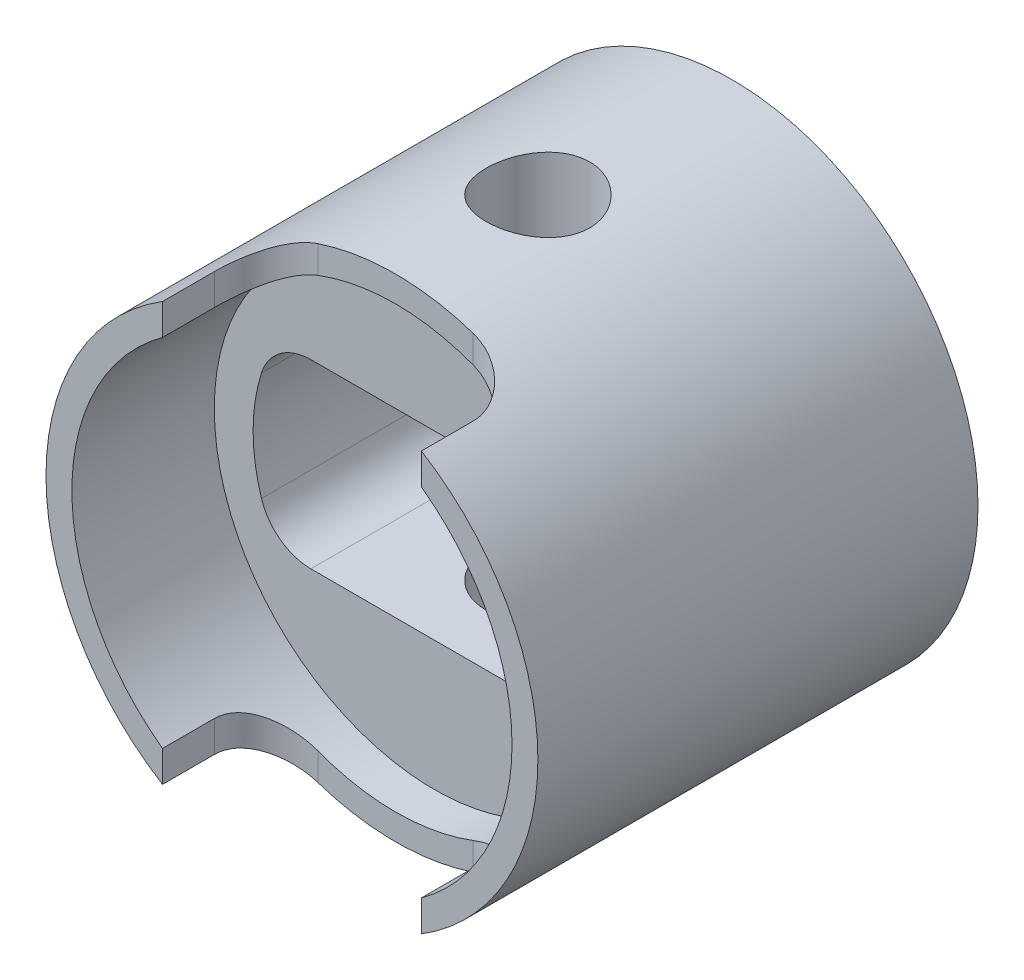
ISO-10303-21;
HEADER;
FILE_DESCRIPTION(('STEP AP214'),'2;1');
FILE_NAME('part.step','',(''),(''),'','','');
FILE_SCHEMA(('AUTOMOTIVE_DESIGN { 1 0 10303 214 1 1 1 1 }'));
ENDSEC;
DATA;
#1=APPLICATION_CONTEXT('core data for automotive mechanical design processes');
#2=APPLICATION_PROTOCOL_DEFINITION('international standard','automotive_design',2000,#1);
#3=PRODUCT_CONTEXT('',#1,'mechanical');
#4=PRODUCT('Part','Part','',(#3));
#5=PRODUCT_RELATED_PRODUCT_CATEGORY('part','',(#4));
#6=PRODUCT_DEFINITION_FORMATION('','',#4);
#7=PRODUCT_DEFINITION_CONTEXT('part definition',#1,'design');
#8=PRODUCT_DEFINITION('design','',#6,#7);
#9=PRODUCT_DEFINITION_SHAPE('','',#8);
#10=(LENGTH_UNIT() NAMED_UNIT(*) SI_UNIT(.MILLI.,.METRE.));
#11=(NAMED_UNIT(*) PLANE_ANGLE_UNIT() SI_UNIT($,.RADIAN.));
#12=(NAMED_UNIT(*) SI_UNIT($,.STERADIAN.) SOLID_ANGLE_UNIT());
#13=UNCERTAINTY_MEASURE_WITH_UNIT(LENGTH_MEASURE(1.E-05),#10,'distance_accuracy_value','');
#14=(GEOMETRIC_REPRESENTATION_CONTEXT(3) GLOBAL_UNCERTAINTY_ASSIGNED_CONTEXT((#13)) GLOBAL_UNIT_ASSIGNED_CONTEXT((#10,
#11,#12)) REPRESENTATION_CONTEXT('',''));
#15=CARTESIAN_POINT('',(0.,0.,0.));
#16=DIRECTION('',(0.,0.,1.));
#17=DIRECTION('',(1.,0.,0.));
#18=AXIS2_PLACEMENT_3D('',#15,#16,#17);
#19=CARTESIAN_POINT('',(0.,-15.,7.5));
#20=DIRECTION('',(0.,1.,0.));
#21=DIRECTION('',(0.,0.,1.));
#22=AXIS2_PLACEMENT_3D('',#19,#20,#21);
#23=CYLINDRICAL_SURFACE('',#22,2.);
#24=CARTESIAN_POINT('',(0.,3.5,7.5));
#25=DIRECTION('',(0.,1.,0.));
#26=DIRECTION('',(-1.,0.,0.));
#27=AXIS2_PLACEMENT_3D('',#24,#25,#26);
#28=CIRCLE('',#27,2.);
#29=CARTESIAN_POINT('',(-2.,3.5,7.5));
#30=VERTEX_POINT('',#29);
#31=EDGE_CURVE('E268',#30,#30,#28,.F.);
#32=ORIENTED_EDGE('',*,*,#31,.T.);
#33=EDGE_LOOP('',(#32));
#34=FACE_BOUND('',#33,.T.);
#35=CARTESIAN_POINT('',(0.,9.5,9.5));
#36=CARTESIAN_POINT('',(-0.111027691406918,9.49999794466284,9.49999607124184));
#37=CARTESIAN_POINT('',(-0.222103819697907,9.49803374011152,9.49072341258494));
#38=CARTESIAN_POINT('',(-0.441107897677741,9.49038773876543,9.45391221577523));
#39=CARTESIAN_POINT('',(-0.54903342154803,9.48470315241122,9.42635997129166));
#40=CARTESIAN_POINT('',(-0.75853895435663,9.47025014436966,9.35388532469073));
#41=CARTESIAN_POINT('',(-0.860125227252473,9.46148482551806,9.30898039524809));
#42=CARTESIAN_POINT('',(-1.05431669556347,9.44181943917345,9.2031289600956));
#43=CARTESIAN_POINT('',(-1.14692225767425,9.43091945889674,9.14218310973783));
#44=CARTESIAN_POINT('',(-1.32191105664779,9.40799939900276,9.0050163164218));
#45=CARTESIAN_POINT('',(-1.40414098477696,9.39596628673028,8.92860195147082));
#46=CARTESIAN_POINT('',(-1.5547158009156,9.37222932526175,8.76308274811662));
#47=CARTESIAN_POINT('',(-1.62305952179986,9.36052550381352,8.67397684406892));
#48=CARTESIAN_POINT('',(-1.74458761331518,9.33864435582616,8.48448418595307));
#49=CARTESIAN_POINT('',(-1.79761077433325,9.3284837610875,8.38399193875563));
#50=CARTESIAN_POINT('',(-1.88595912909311,9.31102569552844,8.17527480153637));
#51=CARTESIAN_POINT('',(-1.92128627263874,9.30372790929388,8.06705076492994));
#52=CARTESIAN_POINT('',(-1.97273711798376,9.29295410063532,7.84759918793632));
#53=CARTESIAN_POINT('',(-1.98913117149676,9.28942433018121,7.73643772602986));
#54=CARTESIAN_POINT('',(-2.00309070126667,9.28642462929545,7.51289040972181));
#55=CARTESIAN_POINT('',(-2.0006583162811,9.28695423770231,7.40050469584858));
#56=CARTESIAN_POINT('',(-1.97725203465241,9.29196471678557,7.17969454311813));
#57=CARTESIAN_POINT('',(-1.95659032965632,9.29637905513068,7.07123527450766));
#58=CARTESIAN_POINT('',(-1.89780570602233,9.30855661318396,6.85935778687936));
#59=CARTESIAN_POINT('',(-1.85968187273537,9.31632000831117,6.75593983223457));
#60=CARTESIAN_POINT('',(-1.76676342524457,9.3343876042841,6.55619311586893));
#61=CARTESIAN_POINT('',(-1.71184711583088,9.34471024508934,6.45992270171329));
#62=CARTESIAN_POINT('',(-1.58698828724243,9.36672168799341,6.27784720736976));
#63=CARTESIAN_POINT('',(-1.51704386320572,9.37841066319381,6.1920434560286));
#64=CARTESIAN_POINT('',(-1.36245319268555,9.40212443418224,6.0315377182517));
#65=CARTESIAN_POINT('',(-1.27754103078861,9.41415127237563,5.95709191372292));
#66=CARTESIAN_POINT('',(-1.09630350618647,9.43697235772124,5.82345749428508));
#67=CARTESIAN_POINT('',(-0.999977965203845,9.44776658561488,5.76426911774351));
#68=CARTESIAN_POINT('',(-0.798347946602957,9.4669373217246,5.66277357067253));
#69=CARTESIAN_POINT('',(-0.69302708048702,9.47530928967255,5.62049804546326));
#70=CARTESIAN_POINT('',(-0.476561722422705,9.48865817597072,5.55431411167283));
#71=CARTESIAN_POINT('',(-0.365418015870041,9.49363555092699,5.5304032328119));
#72=CARTESIAN_POINT('',(-0.142661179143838,9.49957007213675,5.50199549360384));
#73=CARTESIAN_POINT('',(-0.0310945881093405,9.50059973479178,5.4971484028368));
#74=CARTESIAN_POINT('',(0.191254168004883,9.49872522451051,5.50605926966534));
#75=CARTESIAN_POINT('',(0.302036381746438,9.49582129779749,5.51981606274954));
#76=CARTESIAN_POINT('',(0.518524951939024,9.48645148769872,5.56525350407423));
#77=CARTESIAN_POINT('',(0.624271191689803,9.48002177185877,5.5967522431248));
#78=CARTESIAN_POINT('',(0.828980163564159,9.46431934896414,5.67657893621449));
#79=CARTESIAN_POINT('',(0.927942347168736,9.45504641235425,5.72490824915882));
#80=CARTESIAN_POINT('',(1.1177352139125,9.43450639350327,5.83776641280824));
#81=CARTESIAN_POINT('',(1.20843942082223,9.42321429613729,5.90250330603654));
#82=CARTESIAN_POINT('',(1.3778228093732,9.39994292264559,6.0460629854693));
#83=CARTESIAN_POINT('',(1.45650054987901,9.38796356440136,6.12488745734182));
#84=CARTESIAN_POINT('',(1.60096761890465,9.36442002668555,6.2959863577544));
#85=CARTESIAN_POINT('',(1.66651533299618,9.35286635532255,6.38846649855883));
#86=CARTESIAN_POINT('',(1.78114871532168,9.3317158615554,6.58332921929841));
#87=CARTESIAN_POINT('',(1.83023507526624,9.32211895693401,6.68571138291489));
#88=CARTESIAN_POINT('',(1.91023404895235,9.30605568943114,6.89693504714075));
#89=CARTESIAN_POINT('',(1.94124569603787,9.29957230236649,7.00573768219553));
#90=CARTESIAN_POINT('',(1.98450997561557,9.29043690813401,7.22716231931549));
#91=CARTESIAN_POINT('',(1.99676535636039,9.2877843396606,7.33978375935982));
#92=CARTESIAN_POINT('',(2.00205901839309,9.28664441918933,7.56321772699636));
#93=CARTESIAN_POINT('',(1.99547977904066,9.28807416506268,7.67402094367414));
#94=CARTESIAN_POINT('',(1.96414112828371,9.29475130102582,7.89290256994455));
#95=CARTESIAN_POINT('',(1.93938189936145,9.29999865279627,8.00098100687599));
#96=CARTESIAN_POINT('',(1.87256463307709,9.31368082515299,8.21106838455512));
#97=CARTESIAN_POINT('',(1.83055834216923,9.32210610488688,8.31309444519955));
#98=CARTESIAN_POINT('',(1.7304853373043,9.34119928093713,8.50870903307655));
#99=CARTESIAN_POINT('',(1.67241709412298,9.35186739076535,8.60229675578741));
#100=CARTESIAN_POINT('',(1.54058300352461,9.37449454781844,8.78027215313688));
#101=CARTESIAN_POINT('',(1.46654292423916,9.38647407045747,8.86445412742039));
#102=CARTESIAN_POINT('',(1.30542742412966,9.41023256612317,9.01932471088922));
#103=CARTESIAN_POINT('',(1.21834900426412,9.42201149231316,9.09001020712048));
#104=CARTESIAN_POINT('',(1.0323889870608,9.44420645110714,9.21667699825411));
#105=CARTESIAN_POINT('',(0.93337998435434,9.45460471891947,9.27247451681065));
#106=CARTESIAN_POINT('',(0.727194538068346,9.47269018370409,9.36654901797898));
#107=CARTESIAN_POINT('',(0.620025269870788,9.48037972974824,9.40484119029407));
#108=CARTESIAN_POINT('',(0.427239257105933,9.49075437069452,9.45572669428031));
#109=CARTESIAN_POINT('',(0.34269090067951,9.4942005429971,9.47229845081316));
#110=CARTESIAN_POINT('',(0.172104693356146,9.49882411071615,9.49443641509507));
#111=CARTESIAN_POINT('',(0.0860668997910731,9.50000159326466,9.50000304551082));
#112=CARTESIAN_POINT('',(0.,9.5,9.5));
#113=B_SPLINE_CURVE_WITH_KNOTS('',3,(#35,#36,#37,#38,#39,#40,#41,#42,#43,#44,#45,#46,#47,#48,
#49,#50,#51,#52,#53,#54,#55,#56,#57,#58,#59,#60,#61,#62,#63,#64,#65,#66,#67,#68,#69,#70,#71,#72,
#73,#74,#75,#76,#77,#78,#79,#80,#81,#82,#83,#84,#85,#86,#87,#88,#89,#90,#91,#92,#93,#94,#95,#96,
#97,#98,#99,#100,#101,#102,#103,#104,#105,#106,#107,#108,#109,#110,#111,#112),.UNSPECIFIED.,.T.,
.F.,(4,2,2,2,2,2,2,2,2,2,2,2,2,2,2,2,2,2,2,2,2,2,2,2,2,2,2,2,2,2,2,2,2,2,2,2,2,2,4),(0.,
0.332768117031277,0.665786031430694,0.998469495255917,1.33113936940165,1.6682591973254,
2.00540734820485,2.34598369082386,2.68652249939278,3.02213605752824,3.35771148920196,
3.68764911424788,4.01760402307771,4.35000918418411,4.68245650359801,5.02154876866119,
5.36064633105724,5.7003754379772,6.04005883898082,6.37347176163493,6.7068638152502,
7.03689822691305,7.36695929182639,7.70143535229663,8.03595146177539,8.37614947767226,
8.71633319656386,9.05463505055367,9.39288733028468,9.7243196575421,10.0557486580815,
10.3861904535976,10.7166637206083,11.0533410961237,11.3900960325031,11.7308334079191,
12.0712745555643,12.329241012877,12.5871975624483),.UNSPECIFIED.);
#114=CARTESIAN_POINT('',(0.,9.5,9.5));
#115=VERTEX_POINT('',#114);
#116=EDGE_CURVE('E378',#115,#115,#113,.T.);
#117=ORIENTED_EDGE('',*,*,#116,.F.);
#118=EDGE_LOOP('',(#117));
#119=FACE_BOUND('',#118,.T.);
#120=ADVANCED_FACE('F34',(#34,#119),#23,.F.);
#121=CARTESIAN_POINT('',(0.,0.,17.));
#122=DIRECTION('',(0.,0.,1.));
#123=DIRECTION('',(1.,0.,0.));
#124=AXIS2_PLACEMENT_3D('',#121,#122,#123);
#125=PLANE('',#124);
#126=DIRECTION('',(0.,1.,0.));
#127=VECTOR('',#126,1.);
#128=CARTESIAN_POINT('',(-5.,-15.,17.));
#129=LINE('',#128,#127);
#130=CARTESIAN_POINT('',(-5.,6.87386354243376,17.));
#131=VERTEX_POINT('',#130);
#132=CARTESIAN_POINT('',(-5.,8.07774721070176,17.));
#133=VERTEX_POINT('',#132);
#134=EDGE_CURVE('E265',#131,#133,#129,.T.);
#135=ORIENTED_EDGE('',*,*,#134,.T.);
#136=CARTESIAN_POINT('',(0.,0.,17.));
#137=DIRECTION('',(0.,0.,1.));
#138=DIRECTION('',(1.,0.,0.));
#139=AXIS2_PLACEMENT_3D('',#136,#137,#138);
#140=CIRCLE('',#139,9.5);
#141=CARTESIAN_POINT('',(-5.,-8.07774721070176,17.));
#142=VERTEX_POINT('',#141);
#143=EDGE_CURVE('E393',#133,#142,#140,.T.);
#144=ORIENTED_EDGE('',*,*,#143,.T.);
#145=CARTESIAN_POINT('',(-5.,-6.87386354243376,17.));
#146=VERTEX_POINT('',#145);
#147=EDGE_CURVE('E264',#142,#146,#129,.T.);
#148=ORIENTED_EDGE('',*,*,#147,.T.);
#149=CARTESIAN_POINT('',(0.,0.,17.));
#150=DIRECTION('',(0.,0.,1.));
#151=DIRECTION('',(1.,0.,0.));
#152=AXIS2_PLACEMENT_3D('',#149,#150,#151);
#153=CIRCLE('',#152,8.5);
#154=EDGE_CURVE('E382',#131,#146,#153,.T.);
#155=ORIENTED_EDGE('',*,*,#154,.F.);
#156=EDGE_LOOP('',(#135,#144,#148,#155));
#157=FACE_BOUND('',#156,.T.);
#158=ADVANCED_FACE('F415',(#157),#125,.T.);
#159=CARTESIAN_POINT('',(0.,0.,17.));
#160=DIRECTION('',(0.,0.,-1.));
#161=DIRECTION('',(-1.,0.,0.));
#162=AXIS2_PLACEMENT_3D('',#159,#160,#161);
#163=CYLINDRICAL_SURFACE('',#162,9.5);
#164=CARTESIAN_POINT('',(0.,-9.5,9.5));
#165=CARTESIAN_POINT('',(0.111027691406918,-9.49999794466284,9.49999607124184));
#166=CARTESIAN_POINT('',(0.222103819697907,-9.49803374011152,9.49072341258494));
#167=CARTESIAN_POINT('',(0.441107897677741,-9.49038773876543,9.45391221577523));
#168=CARTESIAN_POINT('',(0.54903342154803,-9.48470315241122,9.42635997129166));
#169=CARTESIAN_POINT('',(0.75853895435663,-9.47025014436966,9.35388532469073));
#170=CARTESIAN_POINT('',(0.860125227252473,-9.46148482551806,9.30898039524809));
#171=CARTESIAN_POINT('',(1.05431669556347,-9.44181943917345,9.2031289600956));
#172=CARTESIAN_POINT('',(1.14692225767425,-9.43091945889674,9.14218310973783));
#173=CARTESIAN_POINT('',(1.32191105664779,-9.40799939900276,9.0050163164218));
#174=CARTESIAN_POINT('',(1.40414098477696,-9.39596628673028,8.92860195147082));
#175=CARTESIAN_POINT('',(1.5547158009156,-9.37222932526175,8.76308274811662));
#176=CARTESIAN_POINT('',(1.62305952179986,-9.36052550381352,8.67397684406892));
#177=CARTESIAN_POINT('',(1.74458761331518,-9.33864435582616,8.48448418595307));
#178=CARTESIAN_POINT('',(1.79761077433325,-9.3284837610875,8.38399193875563));
#179=CARTESIAN_POINT('',(1.88595912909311,-9.31102569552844,8.17527480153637));
#180=CARTESIAN_POINT('',(1.92128627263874,-9.30372790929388,8.06705076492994));
#181=CARTESIAN_POINT('',(1.97273711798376,-9.29295410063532,7.84759918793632));
#182=CARTESIAN_POINT('',(1.98913117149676,-9.28942433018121,7.73643772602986));
#183=CARTESIAN_POINT('',(2.00309070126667,-9.28642462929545,7.51289040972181));
#184=CARTESIAN_POINT('',(2.0006583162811,-9.28695423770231,7.40050469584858));
#185=CARTESIAN_POINT('',(1.97725203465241,-9.29196471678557,7.17969454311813));
#186=CARTESIAN_POINT('',(1.95659032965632,-9.29637905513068,7.07123527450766));
#187=CARTESIAN_POINT('',(1.89780570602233,-9.30855661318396,6.85935778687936));
#188=CARTESIAN_POINT('',(1.85968187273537,-9.31632000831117,6.75593983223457));
#189=CARTESIAN_POINT('',(1.76676342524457,-9.3343876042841,6.55619311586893));
#190=CARTESIAN_POINT('',(1.71184711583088,-9.34471024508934,6.45992270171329));
#191=CARTESIAN_POINT('',(1.58698828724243,-9.36672168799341,6.27784720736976));
#192=CARTESIAN_POINT('',(1.51704386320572,-9.37841066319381,6.1920434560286));
#193=CARTESIAN_POINT('',(1.36245319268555,-9.40212443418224,6.0315377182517));
#194=CARTESIAN_POINT('',(1.27754103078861,-9.41415127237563,5.95709191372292));
#195=CARTESIAN_POINT('',(1.09630350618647,-9.43697235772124,5.82345749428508));
#196=CARTESIAN_POINT('',(0.999977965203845,-9.44776658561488,5.76426911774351));
#197=CARTESIAN_POINT('',(0.798347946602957,-9.4669373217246,5.66277357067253));
#198=CARTESIAN_POINT('',(0.69302708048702,-9.47530928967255,5.62049804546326));
#199=CARTESIAN_POINT('',(0.476561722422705,-9.48865817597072,5.55431411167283));
#200=CARTESIAN_POINT('',(0.365418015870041,-9.49363555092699,5.5304032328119));
#201=CARTESIAN_POINT('',(0.142661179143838,-9.49957007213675,5.50199549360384));
#202=CARTESIAN_POINT('',(0.0310945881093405,-9.50059973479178,5.4971484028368));
#203=CARTESIAN_POINT('',(-0.191254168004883,-9.49872522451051,5.50605926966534));
#204=CARTESIAN_POINT('',(-0.302036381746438,-9.49582129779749,5.51981606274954));
#205=CARTESIAN_POINT('',(-0.518524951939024,-9.48645148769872,5.56525350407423));
#206=CARTESIAN_POINT('',(-0.624271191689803,-9.48002177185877,5.5967522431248));
#207=CARTESIAN_POINT('',(-0.828980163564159,-9.46431934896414,5.67657893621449));
#208=CARTESIAN_POINT('',(-0.927942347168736,-9.45504641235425,5.72490824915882));
#209=CARTESIAN_POINT('',(-1.1177352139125,-9.43450639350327,5.83776641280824));
#210=CARTESIAN_POINT('',(-1.20843942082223,-9.42321429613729,5.90250330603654));
#211=CARTESIAN_POINT('',(-1.3778228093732,-9.39994292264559,6.0460629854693));
#212=CARTESIAN_POINT('',(-1.45650054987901,-9.38796356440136,6.12488745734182));
#213=CARTESIAN_POINT('',(-1.60096761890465,-9.36442002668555,6.2959863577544));
#214=CARTESIAN_POINT('',(-1.66651533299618,-9.35286635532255,6.38846649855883));
#215=CARTESIAN_POINT('',(-1.78114871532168,-9.3317158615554,6.58332921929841));
#216=CARTESIAN_POINT('',(-1.83023507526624,-9.32211895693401,6.68571138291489));
#217=CARTESIAN_POINT('',(-1.91023404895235,-9.30605568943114,6.89693504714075));
#218=CARTESIAN_POINT('',(-1.94124569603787,-9.29957230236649,7.00573768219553));
#219=CARTESIAN_POINT('',(-1.98450997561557,-9.29043690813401,7.22716231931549));
#220=CARTESIAN_POINT('',(-1.99676535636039,-9.2877843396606,7.33978375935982));
#221=CARTESIAN_POINT('',(-2.00205901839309,-9.28664441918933,7.56321772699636));
#222=CARTESIAN_POINT('',(-1.99547977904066,-9.28807416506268,7.67402094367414));
#223=CARTESIAN_POINT('',(-1.96414112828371,-9.29475130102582,7.89290256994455));
#224=CARTESIAN_POINT('',(-1.93938189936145,-9.29999865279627,8.00098100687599));
#225=CARTESIAN_POINT('',(-1.87256463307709,-9.31368082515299,8.21106838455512));
#226=CARTESIAN_POINT('',(-1.83055834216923,-9.32210610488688,8.31309444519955));
#227=CARTESIAN_POINT('',(-1.7304853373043,-9.34119928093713,8.50870903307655));
#228=CARTESIAN_POINT('',(-1.67241709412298,-9.35186739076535,8.60229675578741));
#229=CARTESIAN_POINT('',(-1.54058300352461,-9.37449454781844,8.78027215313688));
#230=CARTESIAN_POINT('',(-1.46654292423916,-9.38647407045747,8.86445412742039));
#231=CARTESIAN_POINT('',(-1.30542742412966,-9.41023256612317,9.01932471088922));
#232=CARTESIAN_POINT('',(-1.21834900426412,-9.42201149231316,9.09001020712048));
#233=CARTESIAN_POINT('',(-1.0323889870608,-9.44420645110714,9.21667699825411));
#234=CARTESIAN_POINT('',(-0.93337998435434,-9.45460471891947,9.27247451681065));
#235=CARTESIAN_POINT('',(-0.727194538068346,-9.47269018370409,9.36654901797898));
#236=CARTESIAN_POINT('',(-0.620025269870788,-9.48037972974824,9.40484119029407));
#237=CARTESIAN_POINT('',(-0.427239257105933,-9.49075437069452,9.45572669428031));
#238=CARTESIAN_POINT('',(-0.34269090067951,-9.4942005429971,9.47229845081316));
#239=CARTESIAN_POINT('',(-0.172104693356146,-9.49882411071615,9.49443641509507));
#240=CARTESIAN_POINT('',(-0.0860668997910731,-9.50000159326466,9.50000304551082));
#241=CARTESIAN_POINT('',(0.,-9.5,9.5));
#242=B_SPLINE_CURVE_WITH_KNOTS('',3,(#164,#165,#166,#167,#168,#169,#170,#171,#172,#173,#174,
#175,#176,#177,#178,#179,#180,#181,#182,#183,#184,#185,#186,#187,#188,#189,#190,#191,#192,#193,
#194,#195,#196,#197,#198,#199,#200,#201,#202,#203,#204,#205,#206,#207,#208,#209,#210,#211,#212,
#213,#214,#215,#216,#217,#218,#219,#220,#221,#222,#223,#224,#225,#226,#227,#228,#229,#230,#231,
#232,#233,#234,#235,#236,#237,#238,#239,#240,#241),.UNSPECIFIED.,.T.,.F.,(4,2,2,2,2,2,2,2,2,2,2,
2,2,2,2,2,2,2,2,2,2,2,2,2,2,2,2,2,2,2,2,2,2,2,2,2,2,2,4),(0.,0.332768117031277,
0.665786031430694,0.998469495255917,1.33113936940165,1.6682591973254,2.00540734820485,
2.34598369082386,2.68652249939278,3.02213605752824,3.35771148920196,3.68764911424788,
4.01760402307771,4.35000918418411,4.68245650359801,5.02154876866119,5.36064633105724,
5.7003754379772,6.04005883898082,6.37347176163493,6.7068638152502,7.03689822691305,
7.36695929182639,7.70143535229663,8.03595146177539,8.37614947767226,8.71633319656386,
9.05463505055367,9.39288733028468,9.7243196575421,10.0557486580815,10.3861904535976,
10.7166637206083,11.0533410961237,11.3900960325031,11.7308334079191,12.0712745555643,
12.329241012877,12.5871975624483),.UNSPECIFIED.);
#243=CARTESIAN_POINT('',(0.,-9.5,9.5));
#244=VERTEX_POINT('',#243);
#245=EDGE_CURVE('E383',#244,#244,#242,.T.);
#246=ORIENTED_EDGE('',*,*,#245,.T.);
#247=EDGE_LOOP('',(#246));
#248=FACE_BOUND('',#247,.T.);
#249=ORIENTED_EDGE('',*,*,#116,.T.);
#250=EDGE_LOOP('',(#249));
#251=FACE_BOUND('',#250,.T.);
#252=CARTESIAN_POINT('',(-3.,-9.01387818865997,17.));
#253=CARTESIAN_POINT('',(-2.88966655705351,-9.05059863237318,16.999998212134));
#254=CARTESIAN_POINT('',(-2.7786301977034,-9.08528453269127,16.9908502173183));
#255=CARTESIAN_POINT('',(-2.55824583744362,-9.1497848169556,16.953800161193));
#256=CARTESIAN_POINT('',(-2.44889792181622,-9.17959895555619,16.9258971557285));
#257=CARTESIAN_POINT('',(-2.23510364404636,-9.23398650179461,16.8514230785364));
#258=CARTESIAN_POINT('',(-2.13066689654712,-9.2585499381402,16.8048169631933));
#259=CARTESIAN_POINT('',(-1.9304544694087,-9.30235772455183,16.693861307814));
#260=CARTESIAN_POINT('',(-1.83467784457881,-9.32160265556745,16.6295137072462));
#261=CARTESIAN_POINT('',(-1.65806434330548,-9.35460572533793,16.4871627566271));
#262=CARTESIAN_POINT('',(-1.57684145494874,-9.36852265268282,16.4096745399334));
#263=CARTESIAN_POINT('',(-1.42826197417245,-9.39232363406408,16.2418522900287));
#264=CARTESIAN_POINT('',(-1.36090450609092,-9.40220794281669,16.1515190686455));
#265=CARTESIAN_POINT('',(-1.24295110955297,-9.41852360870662,15.9618207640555));
#266=CARTESIAN_POINT('',(-1.19215469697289,-9.42499690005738,15.8625838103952));
#267=CARTESIAN_POINT('',(-1.10770313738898,-9.43529615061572,15.6569384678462));
#268=CARTESIAN_POINT('',(-1.07404804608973,-9.43912210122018,15.5505300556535));
#269=CARTESIAN_POINT('',(-1.02481453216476,-9.4445951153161,15.3332837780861));
#270=CARTESIAN_POINT('',(-1.00928043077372,-9.44623683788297,15.2224357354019));
#271=CARTESIAN_POINT('',(-0.996891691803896,-9.44755244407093,14.999687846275));
#272=CARTESIAN_POINT('',(-1.00003739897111,-9.4472262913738,14.8877879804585));
#273=CARTESIAN_POINT('',(-1.02494700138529,-9.44455600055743,14.6658365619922));
#274=CARTESIAN_POINT('',(-1.04675461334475,-9.44220712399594,14.5557899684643));
#275=CARTESIAN_POINT('',(-1.10840326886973,-9.4351680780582,14.3409471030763));
#276=CARTESIAN_POINT('',(-1.14824421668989,-9.43047792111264,14.2361508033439));
#277=CARTESIAN_POINT('',(-1.24471353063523,-9.4182290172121,14.0349055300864));
#278=CARTESIAN_POINT('',(-1.30132459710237,-9.41067322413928,13.9384480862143));
#279=CARTESIAN_POINT('',(-1.42960603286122,-9.39203982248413,13.7565171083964));
#280=CARTESIAN_POINT('',(-1.50127556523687,-9.38096240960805,13.6710429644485));
#281=CARTESIAN_POINT('',(-1.65714078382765,-9.35468293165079,13.5137478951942));
#282=CARTESIAN_POINT('',(-1.74129225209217,-9.33949527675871,13.4418807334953));
#283=CARTESIAN_POINT('',(-1.91961559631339,-9.3044783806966,13.3133314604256));
#284=CARTESIAN_POINT('',(-2.01378708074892,-9.28464932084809,13.256648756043));
#285=CARTESIAN_POINT('',(-2.20952078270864,-9.24002802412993,13.1595871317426));
#286=CARTESIAN_POINT('',(-2.3111081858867,-9.21521832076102,13.1192671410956));
#287=CARTESIAN_POINT('',(-2.51827320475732,-9.16077349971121,13.0558600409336));
#288=CARTESIAN_POINT('',(-2.62385128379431,-9.13113782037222,13.0327749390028));
#289=CARTESIAN_POINT('',(-2.8391638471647,-9.06653994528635,13.003431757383));
#290=CARTESIAN_POINT('',(-2.9489288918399,-9.03144610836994,12.9976916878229));
#291=CARTESIAN_POINT('',(-3.16663435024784,-8.95743618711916,13.0039780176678));
#292=CARTESIAN_POINT('',(-3.27457424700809,-8.91851904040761,13.0160093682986));
#293=CARTESIAN_POINT('',(-3.49258104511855,-8.83551306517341,13.058240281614));
#294=CARTESIAN_POINT('',(-3.60237705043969,-8.79125361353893,13.0895018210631));
#295=CARTESIAN_POINT('',(-3.81460218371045,-8.70127104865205,13.1698872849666));
#296=CARTESIAN_POINT('',(-3.91702826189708,-8.65554734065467,13.2190185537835));
#297=CARTESIAN_POINT('',(-4.1180533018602,-8.56181320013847,13.337365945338));
#298=CARTESIAN_POINT('',(-4.21606856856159,-8.51382727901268,13.4075972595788));
#299=CARTESIAN_POINT('',(-4.39877029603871,-8.4208871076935,13.565421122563));
#300=CARTESIAN_POINT('',(-4.48345225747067,-8.37593388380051,13.653019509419));
#301=CARTESIAN_POINT('',(-4.63565782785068,-8.29265430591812,13.8427530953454));
#302=CARTESIAN_POINT('',(-4.70338812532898,-8.25425015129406,13.9446868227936));
#303=CARTESIAN_POINT('',(-4.81994766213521,-8.18673751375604,14.1616117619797));
#304=CARTESIAN_POINT('',(-4.86880142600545,-8.15761697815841,14.2765857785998));
#305=CARTESIAN_POINT('',(-4.93996985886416,-8.11469174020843,14.5013285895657));
#306=CARTESIAN_POINT('',(-4.9647921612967,-8.09945361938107,14.6100258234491));
#307=CARTESIAN_POINT('',(-4.99595604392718,-8.08027119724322,14.8309806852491));
#308=CARTESIAN_POINT('',(-5.00231637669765,-8.07631543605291,14.9432345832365));
#309=CARTESIAN_POINT('',(-4.99655390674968,-8.07987842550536,15.1528318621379));
#310=CARTESIAN_POINT('',(-4.98666041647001,-8.08601331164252,15.2502707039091));
#311=CARTESIAN_POINT('',(-4.95301551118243,-8.10666535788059,15.4417940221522));
#312=CARTESIAN_POINT('',(-4.92926319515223,-8.12118306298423,15.5358782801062));
#313=CARTESIAN_POINT('',(-4.86895846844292,-8.15747941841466,15.7185188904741));
#314=CARTESIAN_POINT('',(-4.8323819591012,-8.17927173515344,15.8070644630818));
#315=CARTESIAN_POINT('',(-4.74783404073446,-8.22863676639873,15.9767666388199));
#316=CARTESIAN_POINT('',(-4.69985898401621,-8.25621133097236,16.0579208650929));
#317=CARTESIAN_POINT('',(-4.58782637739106,-8.31903969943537,16.2205083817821));
#318=CARTESIAN_POINT('',(-4.52255452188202,-8.35481175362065,16.3009030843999));
#319=CARTESIAN_POINT('',(-4.38137376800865,-8.42970673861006,16.4499514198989));
#320=CARTESIAN_POINT('',(-4.30545770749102,-8.46883191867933,16.5185970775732));
#321=CARTESIAN_POINT('',(-4.13413092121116,-8.55390217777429,16.651352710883));
#322=CARTESIAN_POINT('',(-4.03746891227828,-8.60007207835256,16.713709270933));
#323=CARTESIAN_POINT('',(-3.83488990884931,-8.69229521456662,16.8210145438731));
#324=CARTESIAN_POINT('',(-3.72897388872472,-8.73834846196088,16.8659650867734));
#325=CARTESIAN_POINT('',(-3.52061868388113,-8.82421203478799,16.9338555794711));
#326=CARTESIAN_POINT('',(-3.41879887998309,-8.86420073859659,16.9584758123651));
#327=CARTESIAN_POINT('',(-3.21153539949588,-8.94137893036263,16.9915468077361));
#328=CARTESIAN_POINT('',(-3.10609265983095,-8.97856913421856,17.0000017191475));
#329=CARTESIAN_POINT('',(-3.,-9.01387818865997,17.));
#330=B_SPLINE_CURVE_WITH_KNOTS('',3,(#252,#253,#254,#255,#256,#257,#258,#259,#260,#261,#262,
#263,#264,#265,#266,#267,#268,#269,#270,#271,#272,#273,#274,#275,#276,#277,#278,#279,#280,#281,
#282,#283,#284,#285,#286,#287,#288,#289,#290,#291,#292,#293,#294,#295,#296,#297,#298,#299,#300,
#301,#302,#303,#304,#305,#306,#307,#308,#309,#310,#311,#312,#313,#314,#315,#316,#317,#318,#319,
#320,#321,#322,#323,#324,#325,#326,#327,#328,#329),.UNSPECIFIED.,.T.,.F.,(4,2,2,2,2,2,2,2,2,2,2,
2,2,2,2,2,2,2,2,2,2,2,2,2,2,2,2,2,2,2,2,2,2,2,2,2,2,2,4),(0.,0.348485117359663,
0.696987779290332,1.04614649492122,1.39526705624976,1.732975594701,2.07066279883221,
2.40409553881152,2.73752936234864,3.07177701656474,3.40603083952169,3.74106982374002,
4.07610702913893,4.41079981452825,4.74547400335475,5.07898971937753,5.41249240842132,
5.74718574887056,6.08191806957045,6.4265530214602,6.77128400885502,7.13701230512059,
7.50289108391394,7.89038773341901,8.27801486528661,8.66065616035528,9.04279863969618,
9.37839801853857,9.71365639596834,10.0066441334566,10.2996509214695,10.5932112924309,
10.8868657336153,11.214249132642,11.5418538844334,11.9121008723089,12.2823089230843,
12.6174856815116,12.9525764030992),.UNSPECIFIED.);
#331=CARTESIAN_POINT('',(-3.,-9.01387818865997,13.));
#332=VERTEX_POINT('',#331);
#333=CARTESIAN_POINT('',(-5.,-8.07774721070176,15.));
#334=VERTEX_POINT('',#333);
#335=EDGE_CURVE('E359',#332,#334,#330,.T.);
#336=ORIENTED_EDGE('',*,*,#335,.T.);
#337=DIRECTION('',(0.,0.,-1.));
#338=VECTOR('',#337,1.);
#339=CARTESIAN_POINT('',(-5.,-8.07774721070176,17.));
#340=LINE('',#339,#338);
#341=EDGE_CURVE('E372',#334,#142,#340,.F.);
#342=ORIENTED_EDGE('',*,*,#341,.T.);
#343=ORIENTED_EDGE('',*,*,#143,.F.);
#344=DIRECTION('',(0.,0.,-1.));
#345=VECTOR('',#344,1.);
#346=CARTESIAN_POINT('',(-5.,8.07774721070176,17.));
#347=LINE('',#346,#345);
#348=CARTESIAN_POINT('',(-5.,8.07774721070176,15.));
#349=VERTEX_POINT('',#348);
#350=EDGE_CURVE('E375',#133,#349,#347,.T.);
#351=ORIENTED_EDGE('',*,*,#350,.T.);
#352=CARTESIAN_POINT('',(-3.,9.01387818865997,17.));
#353=CARTESIAN_POINT('',(-3.12043712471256,8.97379028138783,16.999994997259));
#354=CARTESIAN_POINT('',(-3.24014895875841,8.93124096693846,16.9890887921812));
#355=CARTESIAN_POINT('',(-3.47460777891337,8.8426736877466,16.9465335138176));
#356=CARTESIAN_POINT('',(-3.58934650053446,8.79665027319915,16.914851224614));
#357=CARTESIAN_POINT('',(-3.8106072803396,8.70308355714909,16.8321648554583));
#358=CARTESIAN_POINT('',(-3.91714805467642,8.65554409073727,16.781206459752));
#359=CARTESIAN_POINT('',(-4.1198052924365,8.56094163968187,16.6612956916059));
#360=CARTESIAN_POINT('',(-4.21592176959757,8.51387865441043,16.59234334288));
#361=CARTESIAN_POINT('',(-4.39773455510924,8.42143746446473,16.4356610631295));
#362=CARTESIAN_POINT('',(-4.48308147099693,8.37613851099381,16.3474763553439));
#363=CARTESIAN_POINT('',(-4.63734565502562,8.29172905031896,16.1551092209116));
#364=CARTESIAN_POINT('',(-4.70626797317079,8.25261664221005,16.0509317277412));
#365=CARTESIAN_POINT('',(-4.82025995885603,8.1865221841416,15.8368394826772));
#366=CARTESIAN_POINT('',(-4.86667072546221,8.15887838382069,15.7278499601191));
#367=CARTESIAN_POINT('',(-4.93977801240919,8.11482933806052,15.5013563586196));
#368=CARTESIAN_POINT('',(-4.96650573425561,8.09840630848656,15.383866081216));
#369=CARTESIAN_POINT('',(-4.99607637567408,8.08018970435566,15.1622474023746));
#370=CARTESIAN_POINT('',(-5.00181466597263,8.07662380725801,15.0586441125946));
#371=CARTESIAN_POINT('',(-4.99718602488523,8.0794891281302,14.8519496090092));
#372=CARTESIAN_POINT('',(-4.9868239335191,8.08591734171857,14.7488582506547));
#373=CARTESIAN_POINT('',(-4.95190740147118,8.1073412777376,14.553685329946));
#374=CARTESIAN_POINT('',(-4.92840557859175,8.1217007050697,14.4613400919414));
#375=CARTESIAN_POINT('',(-4.86911114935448,8.15738606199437,14.2821302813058));
#376=CARTESIAN_POINT('',(-4.83331606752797,8.17871339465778,14.1952668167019));
#377=CARTESIAN_POINT('',(-4.74789951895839,8.22861171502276,14.022898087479));
#378=CARTESIAN_POINT('',(-4.69749593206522,8.25758025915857,13.9378978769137));
#379=CARTESIAN_POINT('',(-4.58576249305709,8.32014916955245,13.7773233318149));
#380=CARTESIAN_POINT('',(-4.52442731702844,8.35375179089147,13.7017536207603));
#381=CARTESIAN_POINT('',(-4.38335269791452,8.42872579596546,13.5514326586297));
#382=CARTESIAN_POINT('',(-4.30224553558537,8.47053284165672,13.4781806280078));
#383=CARTESIAN_POINT('',(-4.12982390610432,8.5559231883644,13.3461244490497));
#384=CARTESIAN_POINT('',(-4.03850382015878,8.59950745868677,13.2873283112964));
#385=CARTESIAN_POINT('',(-3.83792698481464,8.691008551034,13.1800913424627));
#386=CARTESIAN_POINT('',(-3.7277899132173,8.73892104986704,13.133282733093));
#387=CARTESIAN_POINT('',(-3.50008591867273,8.83258460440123,13.0598391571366));
#388=CARTESIAN_POINT('',(-3.38251821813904,8.87833543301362,13.0332063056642));
#389=CARTESIAN_POINT('',(-3.14262598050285,8.96606125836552,13.0014155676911));
#390=CARTESIAN_POINT('',(-3.02028643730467,9.008022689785,12.9963320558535));
#391=CARTESIAN_POINT('',(-2.77504184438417,9.0865668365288,13.0089076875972));
#392=CARTESIAN_POINT('',(-2.65213706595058,9.12315190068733,13.0265568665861));
#393=CARTESIAN_POINT('',(-2.41780694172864,9.18793019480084,13.0830630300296));
#394=CARTESIAN_POINT('',(-2.3061473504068,9.21650797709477,13.1205072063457));
#395=CARTESIAN_POINT('',(-2.0900739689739,9.26789729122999,13.2150837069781));
#396=CARTESIAN_POINT('',(-1.98565767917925,9.29071081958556,13.2722091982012));
#397=CARTESIAN_POINT('',(-1.79360236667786,9.3296335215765,13.400876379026));
#398=CARTESIAN_POINT('',(-1.70534456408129,9.34605218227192,13.4714032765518));
#399=CARTESIAN_POINT('',(-1.54161379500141,9.37445158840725,13.6267418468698));
#400=CARTESIAN_POINT('',(-1.46613926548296,9.38643287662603,13.7115517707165));
#401=CARTESIAN_POINT('',(-1.33185924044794,9.40641697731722,13.891118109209));
#402=CARTESIAN_POINT('',(-1.27274170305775,9.41449683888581,13.9856329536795));
#403=CARTESIAN_POINT('',(-1.17095452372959,9.42769912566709,14.1833281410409));
#404=CARTESIAN_POINT('',(-1.12828475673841,9.4328215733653,14.2865084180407));
#405=CARTESIAN_POINT('',(-1.06065223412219,9.4406665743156,14.4986670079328));
#406=CARTESIAN_POINT('',(-1.03569962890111,9.44338775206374,14.6076486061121));
#407=CARTESIAN_POINT('',(-1.00427264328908,9.4467819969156,14.8282765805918));
#408=CARTESIAN_POINT('',(-0.997798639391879,9.44745502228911,14.9399230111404));
#409=CARTESIAN_POINT('',(-1.00352745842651,9.44684818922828,15.1630679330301));
#410=CARTESIAN_POINT('',(-1.01578652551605,9.44556244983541,15.2745649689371));
#411=CARTESIAN_POINT('',(-1.05872635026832,9.44084526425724,15.4939080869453));
#412=CARTESIAN_POINT('',(-1.08940720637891,9.43741380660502,15.6017541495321));
#413=CARTESIAN_POINT('',(-1.16827489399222,9.42797438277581,15.8107106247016));
#414=CARTESIAN_POINT('',(-1.21645965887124,9.42196672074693,15.9118218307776));
#415=CARTESIAN_POINT('',(-1.32886996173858,9.40676922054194,16.1044253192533));
#416=CARTESIAN_POINT('',(-1.39309436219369,9.39757960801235,16.1959182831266));
#417=CARTESIAN_POINT('',(-1.53534541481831,9.37538607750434,16.3664083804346));
#418=CARTESIAN_POINT('',(-1.61332592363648,9.3623948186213,16.4454456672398));
#419=CARTESIAN_POINT('',(-1.78077023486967,9.33199234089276,16.589231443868));
#420=CARTESIAN_POINT('',(-1.87023542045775,9.3145805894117,16.6539782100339));
#421=CARTESIAN_POINT('',(-2.05781340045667,9.27494421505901,16.7675738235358));
#422=CARTESIAN_POINT('',(-2.15593004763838,9.25271744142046,16.8164155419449));
#423=CARTESIAN_POINT('',(-2.35766299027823,9.20337851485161,16.8971534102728));
#424=CARTESIAN_POINT('',(-2.4612748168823,9.17627028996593,16.9290631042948));
#425=CARTESIAN_POINT('',(-2.63784937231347,9.12673726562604,16.9683151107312));
#426=CARTESIAN_POINT('',(-2.7101774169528,9.1055299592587,16.9802309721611));
#427=CARTESIAN_POINT('',(-2.85509082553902,9.06113702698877,16.9960748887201));
#428=CARTESIAN_POINT('',(-2.92767618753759,9.03795141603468,17.0000030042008));
#429=CARTESIAN_POINT('',(-3.,9.01387818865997,17.));
#430=B_SPLINE_CURVE_WITH_KNOTS('',3,(#352,#353,#354,#355,#356,#357,#358,#359,#360,#361,#362,
#363,#364,#365,#366,#367,#368,#369,#370,#371,#372,#373,#374,#375,#376,#377,#378,#379,#380,#381,
#382,#383,#384,#385,#386,#387,#388,#389,#390,#391,#392,#393,#394,#395,#396,#397,#398,#399,#400,
#401,#402,#403,#404,#405,#406,#407,#408,#409,#410,#411,#412,#413,#414,#415,#416,#417,#418,#419,
#420,#421,#422,#423,#424,#425,#426,#427,#428,#429),.UNSPECIFIED.,.T.,.F.,(4,2,2,2,2,2,2,2,2,2,2,
2,2,2,2,2,2,2,2,2,2,2,2,2,2,2,2,2,2,2,2,2,2,2,2,2,2,2,4),(0.,0.38050906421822,0.761627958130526,
1.14184920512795,1.52206995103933,1.91250739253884,2.3028246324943,2.66556790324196,
3.02773490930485,3.33752174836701,3.64721547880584,3.9350648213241,4.22297216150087,
4.53069719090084,4.83857250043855,5.18817706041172,5.53797491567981,5.92289049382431,
6.3078464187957,6.69412989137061,7.08024409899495,7.44192327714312,7.80347701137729,
8.14429329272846,8.48506787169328,8.81880519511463,9.15253998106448,9.48646581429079,
9.82039845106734,10.1553356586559,10.4902746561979,10.8251741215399,11.1600498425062,
11.4938229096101,11.8276362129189,12.1615989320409,12.4952941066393,12.7237956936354,
12.9522955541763),.UNSPECIFIED.);
#431=CARTESIAN_POINT('',(-3.,9.01387818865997,13.));
#432=VERTEX_POINT('',#431);
#433=EDGE_CURVE('E364',#349,#432,#430,.T.);
#434=ORIENTED_EDGE('',*,*,#433,.T.);
#435=CARTESIAN_POINT('',(0.,0.,13.));
#436=DIRECTION('',(0.,0.,-1.));
#437=DIRECTION('',(-1.,0.,0.));
#438=AXIS2_PLACEMENT_3D('',#435,#436,#437);
#439=CIRCLE('',#438,9.5);
#440=CARTESIAN_POINT('',(3.,9.01387818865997,13.));
#441=VERTEX_POINT('',#440);
#442=EDGE_CURVE('E365',#432,#441,#439,.T.);
#443=ORIENTED_EDGE('',*,*,#442,.T.);
#444=CARTESIAN_POINT('',(3.,9.01387818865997,17.));
#445=CARTESIAN_POINT('',(2.88966655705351,9.05059863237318,16.999998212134));
#446=CARTESIAN_POINT('',(2.7786301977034,9.08528453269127,16.9908502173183));
#447=CARTESIAN_POINT('',(2.55824583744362,9.1497848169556,16.953800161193));
#448=CARTESIAN_POINT('',(2.44889792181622,9.17959895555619,16.9258971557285));
#449=CARTESIAN_POINT('',(2.23510364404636,9.23398650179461,16.8514230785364));
#450=CARTESIAN_POINT('',(2.13066689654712,9.2585499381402,16.8048169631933));
#451=CARTESIAN_POINT('',(1.9304544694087,9.30235772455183,16.693861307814));
#452=CARTESIAN_POINT('',(1.83467784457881,9.32160265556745,16.6295137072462));
#453=CARTESIAN_POINT('',(1.65806434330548,9.35460572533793,16.4871627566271));
#454=CARTESIAN_POINT('',(1.57684145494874,9.36852265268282,16.4096745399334));
#455=CARTESIAN_POINT('',(1.42826197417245,9.39232363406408,16.2418522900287));
#456=CARTESIAN_POINT('',(1.36090450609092,9.40220794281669,16.1515190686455));
#457=CARTESIAN_POINT('',(1.24295110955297,9.41852360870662,15.9618207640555));
#458=CARTESIAN_POINT('',(1.19215469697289,9.42499690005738,15.8625838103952));
#459=CARTESIAN_POINT('',(1.10770313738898,9.43529615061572,15.6569384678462));
#460=CARTESIAN_POINT('',(1.07404804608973,9.43912210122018,15.5505300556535));
#461=CARTESIAN_POINT('',(1.02481453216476,9.4445951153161,15.3332837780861));
#462=CARTESIAN_POINT('',(1.00928043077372,9.44623683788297,15.2224357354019));
#463=CARTESIAN_POINT('',(0.996891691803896,9.44755244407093,14.999687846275));
#464=CARTESIAN_POINT('',(1.00003739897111,9.4472262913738,14.8877879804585));
#465=CARTESIAN_POINT('',(1.02494700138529,9.44455600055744,14.6658365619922));
#466=CARTESIAN_POINT('',(1.04675461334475,9.44220712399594,14.5557899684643));
#467=CARTESIAN_POINT('',(1.10840326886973,9.4351680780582,14.3409471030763));
#468=CARTESIAN_POINT('',(1.14824421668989,9.43047792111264,14.2361508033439));
#469=CARTESIAN_POINT('',(1.24471353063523,9.4182290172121,14.0349055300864));
#470=CARTESIAN_POINT('',(1.30132459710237,9.41067322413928,13.9384480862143));
#471=CARTESIAN_POINT('',(1.42960603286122,9.39203982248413,13.7565171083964));
#472=CARTESIAN_POINT('',(1.50127556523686,9.38096240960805,13.6710429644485));
#473=CARTESIAN_POINT('',(1.65714078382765,9.35468293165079,13.5137478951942));
#474=CARTESIAN_POINT('',(1.74129225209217,9.33949527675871,13.4418807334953));
#475=CARTESIAN_POINT('',(1.91961559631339,9.3044783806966,13.3133314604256));
#476=CARTESIAN_POINT('',(2.01378708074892,9.28464932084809,13.256648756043));
#477=CARTESIAN_POINT('',(2.20952078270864,9.24002802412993,13.1595871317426));
#478=CARTESIAN_POINT('',(2.31110818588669,9.21521832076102,13.1192671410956));
#479=CARTESIAN_POINT('',(2.51827320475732,9.16077349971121,13.0558600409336));
#480=CARTESIAN_POINT('',(2.62385128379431,9.13113782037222,13.0327749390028));
#481=CARTESIAN_POINT('',(2.8391638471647,9.06653994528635,13.003431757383));
#482=CARTESIAN_POINT('',(2.9489288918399,9.03144610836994,12.9976916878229));
#483=CARTESIAN_POINT('',(3.16663435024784,8.95743618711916,13.0039780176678));
#484=CARTESIAN_POINT('',(3.27457424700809,8.91851904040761,13.0160093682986));
#485=CARTESIAN_POINT('',(3.49258104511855,8.83551306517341,13.058240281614));
#486=CARTESIAN_POINT('',(3.60237705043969,8.79125361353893,13.0895018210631));
#487=CARTESIAN_POINT('',(3.81460218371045,8.70127104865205,13.1698872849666));
#488=CARTESIAN_POINT('',(3.91702826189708,8.65554734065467,13.2190185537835));
#489=CARTESIAN_POINT('',(4.1180533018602,8.56181320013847,13.337365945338));
#490=CARTESIAN_POINT('',(4.21606856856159,8.51382727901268,13.4075972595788));
#491=CARTESIAN_POINT('',(4.39877029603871,8.4208871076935,13.565421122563));
#492=CARTESIAN_POINT('',(4.48345225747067,8.37593388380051,13.653019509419));
#493=CARTESIAN_POINT('',(4.63565782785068,8.29265430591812,13.8427530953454));
#494=CARTESIAN_POINT('',(4.70338812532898,8.25425015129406,13.9446868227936));
#495=CARTESIAN_POINT('',(4.81994766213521,8.18673751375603,14.1616117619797));
#496=CARTESIAN_POINT('',(4.86880142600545,8.15761697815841,14.2765857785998));
#497=CARTESIAN_POINT('',(4.93996985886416,8.11469174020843,14.5013285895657));
#498=CARTESIAN_POINT('',(4.9647921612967,8.09945361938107,14.6100258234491));
#499=CARTESIAN_POINT('',(4.99595604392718,8.08027119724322,14.8309806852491));
#500=CARTESIAN_POINT('',(5.00231637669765,8.07631543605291,14.9432345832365));
#501=CARTESIAN_POINT('',(4.99655390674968,8.07987842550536,15.1528318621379));
#502=CARTESIAN_POINT('',(4.98666041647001,8.08601331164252,15.2502707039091));
#503=CARTESIAN_POINT('',(4.95301551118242,8.10666535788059,15.4417940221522));
#504=CARTESIAN_POINT('',(4.92926319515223,8.12118306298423,15.5358782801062));
#505=CARTESIAN_POINT('',(4.86895846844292,8.15747941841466,15.7185188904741));
#506=CARTESIAN_POINT('',(4.8323819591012,8.17927173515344,15.8070644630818));
#507=CARTESIAN_POINT('',(4.74783404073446,8.22863676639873,15.9767666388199));
#508=CARTESIAN_POINT('',(4.69985898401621,8.25621133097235,16.0579208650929));
#509=CARTESIAN_POINT('',(4.58782637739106,8.31903969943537,16.2205083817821));
#510=CARTESIAN_POINT('',(4.52255452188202,8.35481175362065,16.3009030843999));
#511=CARTESIAN_POINT('',(4.38137376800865,8.42970673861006,16.4499514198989));
#512=CARTESIAN_POINT('',(4.30545770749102,8.46883191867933,16.5185970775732));
#513=CARTESIAN_POINT('',(4.13413092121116,8.55390217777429,16.651352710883));
#514=CARTESIAN_POINT('',(4.03746891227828,8.60007207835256,16.713709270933));
#515=CARTESIAN_POINT('',(3.83488990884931,8.69229521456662,16.8210145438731));
#516=CARTESIAN_POINT('',(3.72897388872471,8.73834846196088,16.8659650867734));
#517=CARTESIAN_POINT('',(3.52061868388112,8.82421203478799,16.9338555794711));
#518=CARTESIAN_POINT('',(3.41879887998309,8.86420073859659,16.9584758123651));
#519=CARTESIAN_POINT('',(3.21153539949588,8.94137893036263,16.9915468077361));
#520=CARTESIAN_POINT('',(3.10609265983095,8.97856913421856,17.0000017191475));
#521=CARTESIAN_POINT('',(3.,9.01387818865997,17.));
#522=B_SPLINE_CURVE_WITH_KNOTS('',3,(#444,#445,#446,#447,#448,#449,#450,#451,#452,#453,#454,
#455,#456,#457,#458,#459,#460,#461,#462,#463,#464,#465,#466,#467,#468,#469,#470,#471,#472,#473,
#474,#475,#476,#477,#478,#479,#480,#481,#482,#483,#484,#485,#486,#487,#488,#489,#490,#491,#492,
#493,#494,#495,#496,#497,#498,#499,#500,#501,#502,#503,#504,#505,#506,#507,#508,#509,#510,#511,
#512,#513,#514,#515,#516,#517,#518,#519,#520,#521),.UNSPECIFIED.,.T.,.F.,(4,2,2,2,2,2,2,2,2,2,2,
2,2,2,2,2,2,2,2,2,2,2,2,2,2,2,2,2,2,2,2,2,2,2,2,2,2,2,4),(0.,0.348485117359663,
0.696987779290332,1.04614649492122,1.39526705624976,1.732975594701,2.07066279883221,
2.40409553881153,2.73752936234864,3.07177701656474,3.40603083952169,3.74106982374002,
4.07610702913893,4.41079981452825,4.74547400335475,5.07898971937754,5.41249240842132,
5.74718574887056,6.08191806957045,6.4265530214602,6.77128400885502,7.13701230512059,
7.50289108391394,7.89038773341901,8.27801486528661,8.66065616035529,9.04279863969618,
9.37839801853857,9.71365639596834,10.0066441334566,10.2996509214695,10.5932112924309,
10.8868657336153,11.214249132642,11.5418538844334,11.9121008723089,12.2823089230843,
12.6174856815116,12.9525764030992),.UNSPECIFIED.);
#523=CARTESIAN_POINT('',(5.,8.07774721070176,15.));
#524=VERTEX_POINT('',#523);
#525=EDGE_CURVE('E282',#441,#524,#522,.T.);
#526=ORIENTED_EDGE('',*,*,#525,.T.);
#527=DIRECTION('',(0.,0.,-1.));
#528=VECTOR('',#527,1.);
#529=CARTESIAN_POINT('',(5.,8.07774721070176,17.));
#530=LINE('',#529,#528);
#531=CARTESIAN_POINT('',(5.,8.07774721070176,17.));
#532=VERTEX_POINT('',#531);
#533=EDGE_CURVE('E269',#524,#532,#530,.F.);
#534=ORIENTED_EDGE('',*,*,#533,.T.);
#535=CARTESIAN_POINT('',(5.,-8.07774721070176,17.));
#536=VERTEX_POINT('',#535);
#537=EDGE_CURVE('E390',#536,#532,#140,.T.);
#538=ORIENTED_EDGE('',*,*,#537,.F.);
#539=DIRECTION('',(0.,0.,-1.));
#540=VECTOR('',#539,1.);
#541=CARTESIAN_POINT('',(5.,-8.07774721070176,17.));
#542=LINE('',#541,#540);
#543=CARTESIAN_POINT('',(5.,-8.07774721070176,15.));
#544=VERTEX_POINT('',#543);
#545=EDGE_CURVE('E272',#536,#544,#542,.T.);
#546=ORIENTED_EDGE('',*,*,#545,.T.);
#547=CARTESIAN_POINT('',(3.,-9.01387818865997,17.));
#548=CARTESIAN_POINT('',(3.12043712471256,-8.97379028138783,16.999994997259));
#549=CARTESIAN_POINT('',(3.24014895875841,-8.93124096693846,16.9890887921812));
#550=CARTESIAN_POINT('',(3.47460777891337,-8.8426736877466,16.9465335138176));
#551=CARTESIAN_POINT('',(3.58934650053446,-8.79665027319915,16.914851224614));
#552=CARTESIAN_POINT('',(3.8106072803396,-8.70308355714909,16.8321648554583));
#553=CARTESIAN_POINT('',(3.91714805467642,-8.65554409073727,16.781206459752));
#554=CARTESIAN_POINT('',(4.1198052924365,-8.56094163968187,16.6612956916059));
#555=CARTESIAN_POINT('',(4.21592176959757,-8.51387865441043,16.59234334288));
#556=CARTESIAN_POINT('',(4.39773455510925,-8.42143746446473,16.4356610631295));
#557=CARTESIAN_POINT('',(4.48308147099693,-8.37613851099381,16.3474763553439));
#558=CARTESIAN_POINT('',(4.63734565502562,-8.29172905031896,16.1551092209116));
#559=CARTESIAN_POINT('',(4.70626797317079,-8.25261664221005,16.0509317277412));
#560=CARTESIAN_POINT('',(4.82025995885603,-8.1865221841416,15.8368394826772));
#561=CARTESIAN_POINT('',(4.8666707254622,-8.15887838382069,15.7278499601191));
#562=CARTESIAN_POINT('',(4.93977801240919,-8.11482933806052,15.5013563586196));
#563=CARTESIAN_POINT('',(4.96650573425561,-8.09840630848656,15.383866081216));
#564=CARTESIAN_POINT('',(4.99607637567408,-8.08018970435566,15.1622474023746));
#565=CARTESIAN_POINT('',(5.00181466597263,-8.07662380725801,15.0586441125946));
#566=CARTESIAN_POINT('',(4.99718602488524,-8.0794891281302,14.8519496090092));
#567=CARTESIAN_POINT('',(4.9868239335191,-8.08591734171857,14.7488582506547));
#568=CARTESIAN_POINT('',(4.95190740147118,-8.1073412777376,14.553685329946));
#569=CARTESIAN_POINT('',(4.92840557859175,-8.1217007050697,14.4613400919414));
#570=CARTESIAN_POINT('',(4.86911114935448,-8.15738606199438,14.2821302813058));
#571=CARTESIAN_POINT('',(4.83331606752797,-8.17871339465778,14.1952668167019));
#572=CARTESIAN_POINT('',(4.74789951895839,-8.22861171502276,14.022898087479));
#573=CARTESIAN_POINT('',(4.69749593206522,-8.25758025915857,13.9378978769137));
#574=CARTESIAN_POINT('',(4.58576249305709,-8.32014916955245,13.7773233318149));
#575=CARTESIAN_POINT('',(4.52442731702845,-8.35375179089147,13.7017536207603));
#576=CARTESIAN_POINT('',(4.38335269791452,-8.42872579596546,13.5514326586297));
#577=CARTESIAN_POINT('',(4.30224553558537,-8.47053284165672,13.4781806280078));
#578=CARTESIAN_POINT('',(4.12982390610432,-8.5559231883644,13.3461244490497));
#579=CARTESIAN_POINT('',(4.03850382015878,-8.59950745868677,13.2873283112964));
#580=CARTESIAN_POINT('',(3.83792698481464,-8.691008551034,13.1800913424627));
#581=CARTESIAN_POINT('',(3.7277899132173,-8.73892104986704,13.133282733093));
#582=CARTESIAN_POINT('',(3.50008591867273,-8.83258460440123,13.0598391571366));
#583=CARTESIAN_POINT('',(3.38251821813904,-8.87833543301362,13.0332063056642));
#584=CARTESIAN_POINT('',(3.14262598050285,-8.96606125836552,13.0014155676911));
#585=CARTESIAN_POINT('',(3.02028643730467,-9.008022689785,12.9963320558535));
#586=CARTESIAN_POINT('',(2.77504184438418,-9.0865668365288,13.0089076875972));
#587=CARTESIAN_POINT('',(2.65213706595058,-9.12315190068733,13.0265568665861));
#588=CARTESIAN_POINT('',(2.41780694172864,-9.18793019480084,13.0830630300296));
#589=CARTESIAN_POINT('',(2.3061473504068,-9.21650797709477,13.1205072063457));
#590=CARTESIAN_POINT('',(2.0900739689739,-9.26789729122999,13.2150837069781));
#591=CARTESIAN_POINT('',(1.98565767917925,-9.29071081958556,13.2722091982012));
#592=CARTESIAN_POINT('',(1.79360236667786,-9.3296335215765,13.400876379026));
#593=CARTESIAN_POINT('',(1.70534456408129,-9.34605218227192,13.4714032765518));
#594=CARTESIAN_POINT('',(1.54161379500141,-9.37445158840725,13.6267418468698));
#595=CARTESIAN_POINT('',(1.46613926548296,-9.38643287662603,13.7115517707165));
#596=CARTESIAN_POINT('',(1.33185924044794,-9.40641697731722,13.891118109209));
#597=CARTESIAN_POINT('',(1.27274170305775,-9.41449683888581,13.9856329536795));
#598=CARTESIAN_POINT('',(1.17095452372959,-9.42769912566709,14.1833281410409));
#599=CARTESIAN_POINT('',(1.12828475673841,-9.4328215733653,14.2865084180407));
#600=CARTESIAN_POINT('',(1.06065223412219,-9.4406665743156,14.4986670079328));
#601=CARTESIAN_POINT('',(1.03569962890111,-9.44338775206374,14.6076486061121));
#602=CARTESIAN_POINT('',(1.00427264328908,-9.4467819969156,14.8282765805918));
#603=CARTESIAN_POINT('',(0.997798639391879,-9.4474550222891,14.9399230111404));
#604=CARTESIAN_POINT('',(1.00352745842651,-9.44684818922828,15.1630679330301));
#605=CARTESIAN_POINT('',(1.01578652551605,-9.44556244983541,15.2745649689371));
#606=CARTESIAN_POINT('',(1.05872635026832,-9.44084526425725,15.4939080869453));
#607=CARTESIAN_POINT('',(1.08940720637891,-9.43741380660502,15.6017541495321));
#608=CARTESIAN_POINT('',(1.16827489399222,-9.4279743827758,15.8107106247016));
#609=CARTESIAN_POINT('',(1.21645965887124,-9.42196672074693,15.9118218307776));
#610=CARTESIAN_POINT('',(1.32886996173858,-9.40676922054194,16.1044253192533));
#611=CARTESIAN_POINT('',(1.39309436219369,-9.39757960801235,16.1959182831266));
#612=CARTESIAN_POINT('',(1.53534541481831,-9.37538607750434,16.3664083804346));
#613=CARTESIAN_POINT('',(1.61332592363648,-9.3623948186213,16.4454456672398));
#614=CARTESIAN_POINT('',(1.78077023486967,-9.33199234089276,16.589231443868));
#615=CARTESIAN_POINT('',(1.87023542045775,-9.3145805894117,16.6539782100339));
#616=CARTESIAN_POINT('',(2.05781340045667,-9.27494421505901,16.7675738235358));
#617=CARTESIAN_POINT('',(2.15593004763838,-9.25271744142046,16.8164155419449));
#618=CARTESIAN_POINT('',(2.35766299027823,-9.20337851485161,16.8971534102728));
#619=CARTESIAN_POINT('',(2.4612748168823,-9.17627028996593,16.9290631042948));
#620=CARTESIAN_POINT('',(2.63784937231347,-9.12673726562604,16.9683151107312));
#621=CARTESIAN_POINT('',(2.7101774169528,-9.1055299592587,16.9802309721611));
#622=CARTESIAN_POINT('',(2.85509082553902,-9.06113702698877,16.9960748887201));
#623=CARTESIAN_POINT('',(2.92767618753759,-9.03795141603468,17.0000030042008));
#624=CARTESIAN_POINT('',(3.,-9.01387818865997,17.));
#625=B_SPLINE_CURVE_WITH_KNOTS('',3,(#547,#548,#549,#550,#551,#552,#553,#554,#555,#556,#557,
#558,#559,#560,#561,#562,#563,#564,#565,#566,#567,#568,#569,#570,#571,#572,#573,#574,#575,#576,
#577,#578,#579,#580,#581,#582,#583,#584,#585,#586,#587,#588,#589,#590,#591,#592,#593,#594,#595,
#596,#597,#598,#599,#600,#601,#602,#603,#604,#605,#606,#607,#608,#609,#610,#611,#612,#613,#614,
#615,#616,#617,#618,#619,#620,#621,#622,#623,#624),.UNSPECIFIED.,.T.,.F.,(4,2,2,2,2,2,2,2,2,2,2,
2,2,2,2,2,2,2,2,2,2,2,2,2,2,2,2,2,2,2,2,2,2,2,2,2,2,2,4),(0.,0.38050906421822,0.761627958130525,
1.14184920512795,1.52206995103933,1.91250739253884,2.30282463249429,2.66556790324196,
3.02773490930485,3.33752174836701,3.64721547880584,3.9350648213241,4.22297216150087,
4.53069719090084,4.83857250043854,5.18817706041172,5.53797491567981,5.92289049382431,
6.3078464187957,6.69412989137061,7.08024409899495,7.44192327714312,7.80347701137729,
8.14429329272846,8.48506787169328,8.81880519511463,9.15253998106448,9.48646581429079,
9.82039845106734,10.1553356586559,10.4902746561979,10.8251741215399,11.1600498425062,
11.4938229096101,11.8276362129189,12.1615989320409,12.4952941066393,12.7237956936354,
12.9522955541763),.UNSPECIFIED.);
#626=CARTESIAN_POINT('',(3.,-9.01387818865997,13.));
#627=VERTEX_POINT('',#626);
#628=EDGE_CURVE('E275',#544,#627,#625,.T.);
#629=ORIENTED_EDGE('',*,*,#628,.T.);
#630=EDGE_CURVE('E366',#627,#332,#439,.T.);
#631=ORIENTED_EDGE('',*,*,#630,.T.);
#632=EDGE_LOOP('',(#336,#342,#343,#351,#434,#443,#526,#534,#538,#546,#629,#631));
#633=FACE_BOUND('',#632,.T.);
#634=CARTESIAN_POINT('',(0.,0.,0.));
#635=DIRECTION('',(0.,0.,1.));
#636=DIRECTION('',(1.,0.,0.));
#637=AXIS2_PLACEMENT_3D('',#634,#635,#636);
#638=CIRCLE('',#637,9.5);
#639=CARTESIAN_POINT('',(9.5,0.,0.));
#640=VERTEX_POINT('',#639);
#641=EDGE_CURVE('E387',#640,#640,#638,.T.);
#642=ORIENTED_EDGE('',*,*,#641,.T.);
#643=EDGE_LOOP('',(#642));
#644=FACE_BOUND('',#643,.T.);
#645=ADVANCED_FACE('F36',(#248,#251,#633,#644),#163,.T.);
#646=DIRECTION('',(0.,1.,0.));
#647=VECTOR('',#646,1.);
#648=CARTESIAN_POINT('',(5.,-15.,17.));
#649=LINE('',#648,#647);
#650=CARTESIAN_POINT('',(5.,-6.87386354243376,17.));
#651=VERTEX_POINT('',#650);
#652=EDGE_CURVE('E261',#536,#651,#649,.T.);
#653=ORIENTED_EDGE('',*,*,#652,.F.);
#654=ORIENTED_EDGE('',*,*,#537,.T.);
#655=CARTESIAN_POINT('',(5.,6.87386354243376,17.));
#656=VERTEX_POINT('',#655);
#657=EDGE_CURVE('E262',#656,#532,#649,.T.);
#658=ORIENTED_EDGE('',*,*,#657,.F.);
#659=EDGE_CURVE('E379',#651,#656,#153,.T.);
#660=ORIENTED_EDGE('',*,*,#659,.F.);
#661=EDGE_LOOP('',(#653,#654,#658,#660));
#662=FACE_BOUND('',#661,.T.);
#663=ADVANCED_FACE('F421',(#662),#125,.T.);
#664=CARTESIAN_POINT('',(0.,0.,0.));
#665=DIRECTION('',(0.,0.,1.));
#666=DIRECTION('',(1.,0.,0.));
#667=AXIS2_PLACEMENT_3D('',#664,#665,#666);
#668=PLANE('',#667);
#669=ORIENTED_EDGE('',*,*,#641,.F.);
#670=EDGE_LOOP('',(#669));
#671=FACE_BOUND('',#670,.T.);
#672=ADVANCED_FACE('F331',(#671),#668,.F.);
#673=CARTESIAN_POINT('',(0.,0.,11.5));
#674=DIRECTION('',(0.,0.,1.));
#675=DIRECTION('',(1.,0.,0.));
#676=AXIS2_PLACEMENT_3D('',#673,#674,#675);
#677=CYLINDRICAL_SURFACE('',#676,8.5);
#678=CARTESIAN_POINT('',(0.,0.,11.5));
#679=DIRECTION('',(0.,0.,1.));
#680=DIRECTION('',(1.,0.,0.));
#681=AXIS2_PLACEMENT_3D('',#678,#679,#680);
#682=CIRCLE('',#681,8.5);
#683=CARTESIAN_POINT('',(8.5,0.,11.5));
#684=VERTEX_POINT('',#683);
#685=EDGE_CURVE('E384',#684,#684,#682,.T.);
#686=ORIENTED_EDGE('',*,*,#685,.F.);
#687=EDGE_LOOP('',(#686));
#688=FACE_BOUND('',#687,.T.);
#689=CARTESIAN_POINT('',(-3.,7.95298686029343,17.));
#690=CARTESIAN_POINT('',(-2.89044027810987,7.99430927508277,16.9999929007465));
#691=CARTESIAN_POINT('',(-2.77984930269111,8.03341811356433,16.9909640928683));
#692=CARTESIAN_POINT('',(-2.55979352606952,8.10622917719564,16.9541504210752));
#693=CARTESIAN_POINT('',(-2.45033163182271,8.13991968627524,16.9263255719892));
#694=CARTESIAN_POINT('',(-2.23600742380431,8.20138461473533,16.8518082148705));
#695=CARTESIAN_POINT('',(-2.13115263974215,8.22914961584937,16.805086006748));
#696=CARTESIAN_POINT('',(-1.93000974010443,8.27863521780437,16.6936149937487));
#697=CARTESIAN_POINT('',(-1.83371622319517,8.30035964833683,16.6288776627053));
#698=CARTESIAN_POINT('',(-1.65685227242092,8.33742698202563,16.486050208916));
#699=CARTESIAN_POINT('',(-1.57579999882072,8.35299445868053,16.4086141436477));
#700=CARTESIAN_POINT('',(-1.42746807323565,8.37961982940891,16.2408382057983));
#701=CARTESIAN_POINT('',(-1.36018870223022,8.3906776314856,16.1504980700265));
#702=CARTESIAN_POINT('',(-1.24255184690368,8.40889801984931,15.961049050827));
#703=CARTESIAN_POINT('',(-1.19194429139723,8.4161192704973,15.8621008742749));
#704=CARTESIAN_POINT('',(-1.10776083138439,8.42761417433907,15.6570494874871));
#705=CARTESIAN_POINT('',(-1.07418472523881,8.43188786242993,15.5509463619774));
#706=CARTESIAN_POINT('',(-1.02499040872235,8.43801029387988,15.3342459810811));
#707=CARTESIAN_POINT('',(-1.00942767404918,8.43985154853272,15.2236359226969));
#708=CARTESIAN_POINT('',(-0.996904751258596,8.44134006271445,15.0013514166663));
#709=CARTESIAN_POINT('',(-0.999945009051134,8.44098726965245,14.8896769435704));
#710=CARTESIAN_POINT('',(-1.02457656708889,8.43803261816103,14.6680884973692));
#711=CARTESIAN_POINT('',(-1.04622238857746,8.4354241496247,14.5581806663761));
#712=CARTESIAN_POINT('',(-1.10749394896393,8.427597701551,14.3435925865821));
#713=CARTESIAN_POINT('',(-1.14711958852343,8.42237973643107,14.2389123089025));
#714=CARTESIAN_POINT('',(-1.24308374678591,8.40874999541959,14.037902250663));
#715=CARTESIAN_POINT('',(-1.29940092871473,8.4003422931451,13.9415620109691));
#716=CARTESIAN_POINT('',(-1.42699923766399,8.37960830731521,13.759841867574));
#717=CARTESIAN_POINT('',(-1.49827931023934,8.36728229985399,13.6744611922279));
#718=CARTESIAN_POINT('',(-1.65316103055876,8.33805888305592,13.5173885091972));
#719=CARTESIAN_POINT('',(-1.73670799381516,8.32118149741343,13.4456388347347));
#720=CARTESIAN_POINT('',(-1.91361040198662,8.28228728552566,13.3172333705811));
#721=CARTESIAN_POINT('',(-2.00696540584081,8.26027069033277,13.2605769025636));
#722=CARTESIAN_POINT('',(-2.20087025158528,8.210737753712,13.1633711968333));
#723=CARTESIAN_POINT('',(-2.30144911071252,8.18319833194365,13.1228917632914));
#724=CARTESIAN_POINT('',(-2.5063207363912,8.12279287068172,13.058916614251));
#725=CARTESIAN_POINT('',(-2.61061403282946,8.08992606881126,13.035423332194));
#726=CARTESIAN_POINT('',(-2.82376285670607,8.01807080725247,13.0047679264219));
#727=CARTESIAN_POINT('',(-2.93264684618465,7.97890378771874,12.998227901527));
#728=CARTESIAN_POINT('',(-3.14839169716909,7.89626456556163,13.0025930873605));
#729=CARTESIAN_POINT('',(-3.25525196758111,7.85279112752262,13.0135033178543));
#730=CARTESIAN_POINT('',(-3.47251548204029,7.75929451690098,13.0532512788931));
#731=CARTESIAN_POINT('',(-3.58257539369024,7.70902465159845,13.0833825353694));
#732=CARTESIAN_POINT('',(-3.79529403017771,7.60655704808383,13.1614242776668));
#733=CARTESIAN_POINT('',(-3.89794753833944,7.5543579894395,13.2093471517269));
#734=CARTESIAN_POINT('',(-4.10151525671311,7.44593100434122,13.3262296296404));
#735=CARTESIAN_POINT('',(-4.20165531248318,7.38970965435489,13.3965491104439));
#736=CARTESIAN_POINT('',(-4.38841811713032,7.28034959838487,13.5552514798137));
#737=CARTESIAN_POINT('',(-4.47504715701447,7.22720946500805,13.6436259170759));
#738=CARTESIAN_POINT('',(-4.61870088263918,7.13607648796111,13.8207942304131));
#739=CARTESIAN_POINT('',(-4.67825441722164,7.09704087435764,13.9069997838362));
#740=CARTESIAN_POINT('',(-4.78407595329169,7.02614233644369,14.0899354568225));
#741=CARTESIAN_POINT('',(-4.83035186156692,6.99427514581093,14.1866592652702));
#742=CARTESIAN_POINT('',(-4.90771541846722,6.94021609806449,14.3896646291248));
#743=CARTESIAN_POINT('',(-4.93866858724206,6.91811008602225,14.4960214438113));
#744=CARTESIAN_POINT('',(-4.98258248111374,6.88655496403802,14.7141746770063));
#745=CARTESIAN_POINT('',(-4.99556612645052,6.87708973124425,14.825963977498));
#746=CARTESIAN_POINT('',(-5.00200906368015,6.87240110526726,15.0338292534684));
#747=CARTESIAN_POINT('',(-4.9980636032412,6.87528451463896,15.1297931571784));
#748=CARTESIAN_POINT('',(-4.97663693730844,6.89080967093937,15.3193789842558));
#749=CARTESIAN_POINT('',(-4.95915521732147,6.90345178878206,15.413000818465));
#750=CARTESIAN_POINT('',(-4.91247911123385,6.93673743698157,15.5922140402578));
#751=CARTESIAN_POINT('',(-4.88370288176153,6.95709449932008,15.6779701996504));
#752=CARTESIAN_POINT('',(-4.8157215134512,7.00432256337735,15.8432987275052));
#753=CARTESIAN_POINT('',(-4.77651310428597,7.0311956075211,15.9228691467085));
#754=CARTESIAN_POINT('',(-4.68332530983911,7.09365838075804,16.084528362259));
#755=CARTESIAN_POINT('',(-4.62809681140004,7.12992387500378,16.16563273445));
#756=CARTESIAN_POINT('',(-4.50763314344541,7.20668793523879,16.3177515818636));
#757=CARTESIAN_POINT('',(-4.44239278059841,7.24718869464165,16.3887607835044));
#758=CARTESIAN_POINT('',(-4.29108072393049,7.33796253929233,16.53158204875));
#759=CARTESIAN_POINT('',(-4.20336183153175,7.38870479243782,16.6013563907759));
#760=CARTESIAN_POINT('',(-4.01785818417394,7.49119915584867,16.7252306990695));
#761=CARTESIAN_POINT('',(-3.92006064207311,7.54295247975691,16.7793104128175));
#762=CARTESIAN_POINT('',(-3.70583821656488,7.65065811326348,16.8753559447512));
#763=CARTESIAN_POINT('',(-3.58853236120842,7.70649340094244,16.9154986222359));
#764=CARTESIAN_POINT('',(-3.34714238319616,7.814344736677,16.9735260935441));
#765=CARTESIAN_POINT('',(-3.22308096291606,7.86637234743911,16.9914811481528));
#766=CARTESIAN_POINT('',(-3.06512923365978,7.92819163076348,16.9992049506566));
#767=CARTESIAN_POINT('',(-3.03261029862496,7.94068730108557,17.0000021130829));
#768=CARTESIAN_POINT('',(-3.,7.95298686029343,17.));
#769=B_SPLINE_CURVE_WITH_KNOTS('',3,(#689,#690,#691,#692,#693,#694,#695,#696,#697,#698,#699,
#700,#701,#702,#703,#704,#705,#706,#707,#708,#709,#710,#711,#712,#713,#714,#715,#716,#717,#718,
#719,#720,#721,#722,#723,#724,#725,#726,#727,#728,#729,#730,#731,#732,#733,#734,#735,#736,#737,
#738,#739,#740,#741,#742,#743,#744,#745,#746,#747,#748,#749,#750,#751,#752,#753,#754,#755,#756,
#757,#758,#759,#760,#761,#762,#763,#764,#765,#766,#767,#768),.UNSPECIFIED.,.T.,.F.,(4,2,2,2,2,2,
2,2,2,2,2,2,2,2,2,2,2,2,2,2,2,2,2,2,2,2,2,2,2,2,2,2,2,2,2,2,2,2,2,4),(0.,0.351189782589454,
0.703129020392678,1.05562354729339,1.40789408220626,1.74576364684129,2.08364010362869,
2.41618950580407,2.74873497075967,3.08230187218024,3.41587676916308,3.75043251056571,
4.08498640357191,4.41911446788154,4.75321899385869,5.08587695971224,5.41851997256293,
5.75258323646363,6.0866943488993,6.43290258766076,6.77921043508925,7.15171112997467,
7.52447168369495,7.92659904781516,8.32853861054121,8.66263835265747,8.99653872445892,
9.33331979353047,9.66967089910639,9.95645562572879,10.2432512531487,10.5203021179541,
10.7974399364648,11.1100994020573,11.4229216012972,11.7905340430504,12.1586187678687,
12.5646427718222,12.9693777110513,13.0739088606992),.UNSPECIFIED.);
#770=CARTESIAN_POINT('',(-3.,7.95298686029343,13.));
#771=VERTEX_POINT('',#770);
#772=CARTESIAN_POINT('',(-5.,6.87386354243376,15.));
#773=VERTEX_POINT('',#772);
#774=EDGE_CURVE('E321',#771,#773,#769,.T.);
#775=ORIENTED_EDGE('',*,*,#774,.T.);
#776=DIRECTION('',(0.,0.,1.));
#777=VECTOR('',#776,1.);
#778=CARTESIAN_POINT('',(-5.,6.87386354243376,11.5));
#779=LINE('',#778,#777);
#780=EDGE_CURVE('E468',#773,#131,#779,.T.);
#781=ORIENTED_EDGE('',*,*,#780,.T.);
#782=ORIENTED_EDGE('',*,*,#154,.T.);
#783=DIRECTION('',(0.,0.,1.));
#784=VECTOR('',#783,1.);
#785=CARTESIAN_POINT('',(-5.,-6.87386354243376,11.5));
#786=LINE('',#785,#784);
#787=CARTESIAN_POINT('',(-5.,-6.87386354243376,15.));
#788=VERTEX_POINT('',#787);
#789=EDGE_CURVE('E343',#146,#788,#786,.F.);
#790=ORIENTED_EDGE('',*,*,#789,.T.);
#791=CARTESIAN_POINT('',(-3.,-7.95298686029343,17.));
#792=CARTESIAN_POINT('',(-3.12269044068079,-7.9067029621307,16.99999745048));
#793=CARTESIAN_POINT('',(-3.244326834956,-7.85754581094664,16.9886850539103));
#794=CARTESIAN_POINT('',(-3.48195263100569,-7.75517863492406,16.944827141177));
#795=CARTESIAN_POINT('',(-3.59793739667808,-7.70196537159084,16.9122644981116));
#796=CARTESIAN_POINT('',(-3.82112849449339,-7.59370268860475,16.8275552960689));
#797=CARTESIAN_POINT('',(-3.92835821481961,-7.5386587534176,16.7754631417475));
#798=CARTESIAN_POINT('',(-4.1321239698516,-7.42892712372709,16.653007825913));
#799=CARTESIAN_POINT('',(-4.22865416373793,-7.3742396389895,16.5826347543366));
#800=CARTESIAN_POINT('',(-4.41221753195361,-7.26595683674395,16.4216654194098));
#801=CARTESIAN_POINT('',(-4.49872758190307,-7.21248915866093,16.3303823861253));
#802=CARTESIAN_POINT('',(-4.65453004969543,-7.11293839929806,16.130708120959));
#803=CARTESIAN_POINT('',(-4.72385082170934,-7.06684320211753,16.0223455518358));
#804=CARTESIAN_POINT('',(-4.82584232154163,-6.9974273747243,15.8218015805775));
#805=CARTESIAN_POINT('',(-4.86335664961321,-6.97131273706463,15.7330410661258));
#806=CARTESIAN_POINT('',(-4.92556374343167,-6.92750151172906,15.5491766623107));
#807=CARTESIAN_POINT('',(-4.95026954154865,-6.9097963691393,15.4540793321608));
#808=CARTESIAN_POINT('',(-4.98557826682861,-6.88436647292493,15.259434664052));
#809=CARTESIAN_POINT('',(-4.99610705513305,-6.87669419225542,15.1598667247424));
#810=CARTESIAN_POINT('',(-5.00209550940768,-6.87234015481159,14.9600342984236));
#811=CARTESIAN_POINT('',(-4.9975575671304,-6.87565665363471,14.8597699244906));
#812=CARTESIAN_POINT('',(-4.97474573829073,-6.89217438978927,14.6702593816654));
#813=CARTESIAN_POINT('',(-4.95764825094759,-6.90452870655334,14.5807913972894));
#814=CARTESIAN_POINT('',(-4.91199136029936,-6.93708297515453,14.4063466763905));
#815=CARTESIAN_POINT('',(-4.88342919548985,-6.95728481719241,14.3213710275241));
#816=CARTESIAN_POINT('',(-4.81404396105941,-7.00548779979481,14.1526142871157));
#817=CARTESIAN_POINT('',(-4.77259044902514,-7.03388271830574,14.069207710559));
#818=CARTESIAN_POINT('',(-4.67965669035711,-7.09605089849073,13.9103988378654));
#819=CARTESIAN_POINT('',(-4.62817166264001,-7.12982672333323,13.8350003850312));
#820=CARTESIAN_POINT('',(-4.50709426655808,-7.20708493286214,13.6809831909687));
#821=CARTESIAN_POINT('',(-4.43591291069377,-7.25124459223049,13.6039533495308));
#822=CARTESIAN_POINT('',(-4.28343072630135,-7.34235148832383,13.4625896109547));
#823=CARTESIAN_POINT('',(-4.20212285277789,-7.38930065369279,13.3982646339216));
#824=CARTESIAN_POINT('',(-4.01793686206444,-7.49125142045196,13.2743375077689));
#825=CARTESIAN_POINT('',(-3.91365656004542,-7.54639636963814,13.2169233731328));
#826=CARTESIAN_POINT('',(-3.69597001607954,-7.65536613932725,13.1212325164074));
#827=CARTESIAN_POINT('',(-3.58256054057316,-7.70919048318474,13.082962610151));
#828=CARTESIAN_POINT('',(-3.34499367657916,-7.81527445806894,13.0260656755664));
#829=CARTESIAN_POINT('',(-3.22059665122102,-7.86740865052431,13.0081927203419));
#830=CARTESIAN_POINT('',(-2.96842729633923,-7.96597325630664,12.9962760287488));
#831=CARTESIAN_POINT('',(-2.8406566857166,-8.01240650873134,13.0022203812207));
#832=CARTESIAN_POINT('',(-2.59511625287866,-8.09512142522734,13.0377635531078));
#833=CARTESIAN_POINT('',(-2.47726808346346,-8.13188412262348,13.0656911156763));
#834=CARTESIAN_POINT('',(-2.2468824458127,-8.19852927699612,13.1432393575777));
#835=CARTESIAN_POINT('',(-2.13434212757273,-8.22841546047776,13.1928482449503));
#836=CARTESIAN_POINT('',(-1.92791352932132,-8.27910265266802,13.3078309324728));
#837=CARTESIAN_POINT('',(-1.83325254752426,-8.30044684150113,13.3715832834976));
#838=CARTESIAN_POINT('',(-1.65555643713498,-8.33770846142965,13.5149107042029));
#839=CARTESIAN_POINT('',(-1.57251887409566,-8.35362702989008,13.5944824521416));
#840=CARTESIAN_POINT('',(-1.42378917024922,-8.38023517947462,13.7639551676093));
#841=CARTESIAN_POINT('',(-1.35757241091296,-8.39109518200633,13.8533700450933));
#842=CARTESIAN_POINT('',(-1.24075145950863,-8.40916413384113,14.0422061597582));
#843=CARTESIAN_POINT('',(-1.19014673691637,-8.41637320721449,14.1416270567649));
#844=CARTESIAN_POINT('',(-1.1062361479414,-8.42781349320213,14.3473400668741));
#845=CARTESIAN_POINT('',(-1.07288116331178,-8.4320531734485,14.4536116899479));
#846=CARTESIAN_POINT('',(-1.02424352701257,-8.43809999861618,14.6702808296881));
#847=CARTESIAN_POINT('',(-1.00896130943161,-8.43990708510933,14.7806784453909));
#848=CARTESIAN_POINT('',(-0.996894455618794,-8.44134117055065,15.0029606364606));
#849=CARTESIAN_POINT('',(-1.00018780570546,-8.44095897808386,15.1148495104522));
#850=CARTESIAN_POINT('',(-1.02535695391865,-8.4379381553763,15.3364879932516));
#851=CARTESIAN_POINT('',(-1.04723297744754,-8.43529949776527,15.4462375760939));
#852=CARTESIAN_POINT('',(-1.10894488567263,-8.42740778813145,15.6605737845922));
#853=CARTESIAN_POINT('',(-1.1487964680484,-8.42215245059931,15.7651558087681));
#854=CARTESIAN_POINT('',(-1.2452499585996,-8.40843107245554,15.9660572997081));
#855=CARTESIAN_POINT('',(-1.30185117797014,-8.39996516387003,16.062377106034));
#856=CARTESIAN_POINT('',(-1.42981176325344,-8.37912949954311,16.2436959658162));
#857=CARTESIAN_POINT('',(-1.50112125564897,-8.36677286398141,16.3287317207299));
#858=CARTESIAN_POINT('',(-1.65631138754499,-8.33743675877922,16.4854841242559));
#859=CARTESIAN_POINT('',(-1.7401914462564,-8.32045750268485,16.5572013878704));
#860=CARTESIAN_POINT('',(-1.91754872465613,-8.28137784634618,16.6853005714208));
#861=CARTESIAN_POINT('',(-2.01100227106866,-8.25928991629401,16.7417191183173));
#862=CARTESIAN_POINT('',(-2.2046305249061,-8.20972463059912,16.8382297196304));
#863=CARTESIAN_POINT('',(-2.30480420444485,-8.18224809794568,16.8783242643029));
#864=CARTESIAN_POINT('',(-2.5039938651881,-8.12344065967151,16.9401914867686));
#865=CARTESIAN_POINT('',(-2.60284361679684,-8.09235110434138,16.9627355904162));
#866=CARTESIAN_POINT('',(-2.80135739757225,-8.02579430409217,16.9926434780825));
#867=CARTESIAN_POINT('',(-2.9010216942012,-7.99032556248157,17.0000020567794));
#868=CARTESIAN_POINT('',(-3.,-7.95298686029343,17.));
#869=B_SPLINE_CURVE_WITH_KNOTS('',3,(#791,#792,#793,#794,#795,#796,#797,#798,#799,#800,#801,
#802,#803,#804,#805,#806,#807,#808,#809,#810,#811,#812,#813,#814,#815,#816,#817,#818,#819,#820,
#821,#822,#823,#824,#825,#826,#827,#828,#829,#830,#831,#832,#833,#834,#835,#836,#837,#838,#839,
#840,#841,#842,#843,#844,#845,#846,#847,#848,#849,#850,#851,#852,#853,#854,#855,#856,#857,#858,
#859,#860,#861,#862,#863,#864,#865,#866,#867,#868),.UNSPECIFIED.,.T.,.F.,(4,2,2,2,2,2,2,2,2,2,2,
2,2,2,2,2,2,2,2,2,2,2,2,2,2,2,2,2,2,2,2,2,2,2,2,2,2,2,4),(0.,0.392979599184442,
0.786276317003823,1.17848544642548,1.5709076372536,1.97877042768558,2.38595589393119,
2.68426475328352,2.98226949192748,3.28182667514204,3.58133630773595,3.85588218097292,
4.13049422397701,4.42150881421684,4.71266244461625,5.05275439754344,5.39308428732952,
5.7849193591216,6.17689383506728,6.58293268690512,6.98876850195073,7.36642262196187,
7.7438715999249,8.09044629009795,8.43694828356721,8.77073722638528,9.10451482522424,
9.43733669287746,9.77016655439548,10.1043947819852,10.4386270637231,10.7731517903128,
11.1076627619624,11.4410575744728,11.774436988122,12.107011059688,12.439534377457,
12.7564549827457,13.0734842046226),.UNSPECIFIED.);
#870=CARTESIAN_POINT('',(-3.,-7.95298686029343,13.));
#871=VERTEX_POINT('',#870);
#872=EDGE_CURVE('E338',#788,#871,#869,.T.);
#873=ORIENTED_EDGE('',*,*,#872,.T.);
#874=CARTESIAN_POINT('',(0.,0.,13.));
#875=DIRECTION('',(0.,0.,-1.));
#876=DIRECTION('',(-1.,0.,0.));
#877=AXIS2_PLACEMENT_3D('',#874,#875,#876);
#878=CIRCLE('',#877,8.5);
#879=CARTESIAN_POINT('',(3.,-7.95298686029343,13.));
#880=VERTEX_POINT('',#879);
#881=EDGE_CURVE('E344',#871,#880,#878,.F.);
#882=ORIENTED_EDGE('',*,*,#881,.T.);
#883=CARTESIAN_POINT('',(3.,-7.95298686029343,17.));
#884=CARTESIAN_POINT('',(2.89044027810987,-7.99430927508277,16.9999929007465));
#885=CARTESIAN_POINT('',(2.77984930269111,-8.03341811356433,16.9909640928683));
#886=CARTESIAN_POINT('',(2.55979352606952,-8.10622917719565,16.9541504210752));
#887=CARTESIAN_POINT('',(2.45033163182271,-8.13991968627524,16.9263255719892));
#888=CARTESIAN_POINT('',(2.23600742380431,-8.20138461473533,16.8518082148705));
#889=CARTESIAN_POINT('',(2.13115263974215,-8.22914961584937,16.805086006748));
#890=CARTESIAN_POINT('',(1.93000974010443,-8.27863521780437,16.6936149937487));
#891=CARTESIAN_POINT('',(1.83371622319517,-8.30035964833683,16.6288776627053));
#892=CARTESIAN_POINT('',(1.65685227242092,-8.33742698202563,16.486050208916));
#893=CARTESIAN_POINT('',(1.57579999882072,-8.35299445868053,16.4086141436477));
#894=CARTESIAN_POINT('',(1.42746807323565,-8.37961982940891,16.2408382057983));
#895=CARTESIAN_POINT('',(1.36018870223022,-8.3906776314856,16.1504980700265));
#896=CARTESIAN_POINT('',(1.24255184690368,-8.40889801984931,15.961049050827));
#897=CARTESIAN_POINT('',(1.19194429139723,-8.4161192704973,15.8621008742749));
#898=CARTESIAN_POINT('',(1.10776083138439,-8.42761417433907,15.6570494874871));
#899=CARTESIAN_POINT('',(1.07418472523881,-8.43188786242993,15.5509463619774));
#900=CARTESIAN_POINT('',(1.02499040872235,-8.43801029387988,15.3342459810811));
#901=CARTESIAN_POINT('',(1.00942767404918,-8.43985154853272,15.2236359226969));
#902=CARTESIAN_POINT('',(0.996904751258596,-8.44134006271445,15.0013514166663));
#903=CARTESIAN_POINT('',(0.999945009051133,-8.44098726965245,14.8896769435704));
#904=CARTESIAN_POINT('',(1.02457656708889,-8.43803261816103,14.6680884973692));
#905=CARTESIAN_POINT('',(1.04622238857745,-8.4354241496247,14.5581806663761));
#906=CARTESIAN_POINT('',(1.10749394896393,-8.427597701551,14.3435925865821));
#907=CARTESIAN_POINT('',(1.14711958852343,-8.42237973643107,14.2389123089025));
#908=CARTESIAN_POINT('',(1.24308374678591,-8.40874999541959,14.037902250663));
#909=CARTESIAN_POINT('',(1.29940092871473,-8.4003422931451,13.9415620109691));
#910=CARTESIAN_POINT('',(1.42699923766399,-8.37960830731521,13.759841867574));
#911=CARTESIAN_POINT('',(1.49827931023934,-8.36728229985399,13.6744611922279));
#912=CARTESIAN_POINT('',(1.65316103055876,-8.33805888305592,13.5173885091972));
#913=CARTESIAN_POINT('',(1.73670799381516,-8.32118149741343,13.4456388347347));
#914=CARTESIAN_POINT('',(1.91361040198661,-8.28228728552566,13.3172333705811));
#915=CARTESIAN_POINT('',(2.00696540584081,-8.26027069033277,13.2605769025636));
#916=CARTESIAN_POINT('',(2.20087025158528,-8.210737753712,13.1633711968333));
#917=CARTESIAN_POINT('',(2.30144911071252,-8.18319833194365,13.1228917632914));
#918=CARTESIAN_POINT('',(2.5063207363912,-8.12279287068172,13.058916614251));
#919=CARTESIAN_POINT('',(2.61061403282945,-8.08992606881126,13.035423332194));
#920=CARTESIAN_POINT('',(2.82376285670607,-8.01807080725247,13.0047679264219));
#921=CARTESIAN_POINT('',(2.93264684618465,-7.97890378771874,12.998227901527));
#922=CARTESIAN_POINT('',(3.14839169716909,-7.89626456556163,13.0025930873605));
#923=CARTESIAN_POINT('',(3.25525196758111,-7.85279112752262,13.0135033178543));
#924=CARTESIAN_POINT('',(3.47251548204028,-7.75929451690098,13.0532512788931));
#925=CARTESIAN_POINT('',(3.58257539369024,-7.70902465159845,13.0833825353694));
#926=CARTESIAN_POINT('',(3.79529403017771,-7.60655704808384,13.1614242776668));
#927=CARTESIAN_POINT('',(3.89794753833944,-7.55435798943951,13.2093471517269));
#928=CARTESIAN_POINT('',(4.10151525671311,-7.44593100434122,13.3262296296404));
#929=CARTESIAN_POINT('',(4.20165531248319,-7.38970965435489,13.3965491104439));
#930=CARTESIAN_POINT('',(4.38841811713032,-7.28034959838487,13.5552514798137));
#931=CARTESIAN_POINT('',(4.47504715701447,-7.22720946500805,13.6436259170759));
#932=CARTESIAN_POINT('',(4.61870088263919,-7.13607648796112,13.8207942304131));
#933=CARTESIAN_POINT('',(4.67825441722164,-7.09704087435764,13.9069997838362));
#934=CARTESIAN_POINT('',(4.78407595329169,-7.02614233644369,14.0899354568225));
#935=CARTESIAN_POINT('',(4.83035186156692,-6.99427514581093,14.1866592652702));
#936=CARTESIAN_POINT('',(4.90771541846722,-6.94021609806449,14.3896646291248));
#937=CARTESIAN_POINT('',(4.93866858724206,-6.91811008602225,14.4960214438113));
#938=CARTESIAN_POINT('',(4.98258248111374,-6.88655496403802,14.7141746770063));
#939=CARTESIAN_POINT('',(4.99556612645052,-6.87708973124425,14.825963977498));
#940=CARTESIAN_POINT('',(5.00200906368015,-6.87240110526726,15.0338292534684));
#941=CARTESIAN_POINT('',(4.9980636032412,-6.87528451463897,15.1297931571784));
#942=CARTESIAN_POINT('',(4.97663693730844,-6.89080967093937,15.3193789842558));
#943=CARTESIAN_POINT('',(4.95915521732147,-6.90345178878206,15.413000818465));
#944=CARTESIAN_POINT('',(4.91247911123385,-6.93673743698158,15.5922140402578));
#945=CARTESIAN_POINT('',(4.88370288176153,-6.95709449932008,15.6779701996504));
#946=CARTESIAN_POINT('',(4.8157215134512,-7.00432256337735,15.8432987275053));
#947=CARTESIAN_POINT('',(4.77651310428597,-7.0311956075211,15.9228691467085));
#948=CARTESIAN_POINT('',(4.6833253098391,-7.09365838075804,16.084528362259));
#949=CARTESIAN_POINT('',(4.62809681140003,-7.12992387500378,16.16563273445));
#950=CARTESIAN_POINT('',(4.50763314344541,-7.20668793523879,16.3177515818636));
#951=CARTESIAN_POINT('',(4.44239278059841,-7.24718869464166,16.3887607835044));
#952=CARTESIAN_POINT('',(4.29108072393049,-7.33796253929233,16.53158204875));
#953=CARTESIAN_POINT('',(4.20336183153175,-7.38870479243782,16.6013563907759));
#954=CARTESIAN_POINT('',(4.01785818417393,-7.49119915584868,16.7252306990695));
#955=CARTESIAN_POINT('',(3.9200606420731,-7.54295247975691,16.7793104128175));
#956=CARTESIAN_POINT('',(3.70583821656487,-7.65065811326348,16.8753559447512));
#957=CARTESIAN_POINT('',(3.58853236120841,-7.70649340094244,16.9154986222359));
#958=CARTESIAN_POINT('',(3.34714238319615,-7.814344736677,16.9735260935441));
#959=CARTESIAN_POINT('',(3.22308096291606,-7.86637234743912,16.9914811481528));
#960=CARTESIAN_POINT('',(3.06512923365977,-7.92819163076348,16.9992049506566));
#961=CARTESIAN_POINT('',(3.03261029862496,-7.94068730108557,17.0000021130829));
#962=CARTESIAN_POINT('',(3.,-7.95298686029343,17.));
#963=B_SPLINE_CURVE_WITH_KNOTS('',3,(#883,#884,#885,#886,#887,#888,#889,#890,#891,#892,#893,
#894,#895,#896,#897,#898,#899,#900,#901,#902,#903,#904,#905,#906,#907,#908,#909,#910,#911,#912,
#913,#914,#915,#916,#917,#918,#919,#920,#921,#922,#923,#924,#925,#926,#927,#928,#929,#930,#931,
#932,#933,#934,#935,#936,#937,#938,#939,#940,#941,#942,#943,#944,#945,#946,#947,#948,#949,#950,
#951,#952,#953,#954,#955,#956,#957,#958,#959,#960,#961,#962),.UNSPECIFIED.,.T.,.F.,(4,2,2,2,2,2,
2,2,2,2,2,2,2,2,2,2,2,2,2,2,2,2,2,2,2,2,2,2,2,2,2,2,2,2,2,2,2,2,2,4),(0.,0.351189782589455,
0.703129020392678,1.05562354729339,1.40789408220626,1.74576364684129,2.08364010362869,
2.41618950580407,2.74873497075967,3.08230187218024,3.41587676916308,3.75043251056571,
4.08498640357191,4.41911446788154,4.75321899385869,5.08587695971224,5.41851997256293,
5.75258323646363,6.0866943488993,6.43290258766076,6.77921043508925,7.15171112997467,
7.52447168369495,7.92659904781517,8.32853861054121,8.66263835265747,8.99653872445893,
9.33331979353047,9.66967089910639,9.95645562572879,10.2432512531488,10.5203021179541,
10.7974399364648,11.1100994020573,11.4229216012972,11.7905340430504,12.1586187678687,
12.5646427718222,12.9693777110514,13.0739088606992),.UNSPECIFIED.);
#964=CARTESIAN_POINT('',(5.,-6.87386354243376,15.));
#965=VERTEX_POINT('',#964);
#966=EDGE_CURVE('E302',#880,#965,#963,.T.);
#967=ORIENTED_EDGE('',*,*,#966,.T.);
#968=DIRECTION('',(0.,0.,1.));
#969=VECTOR('',#968,1.);
#970=CARTESIAN_POINT('',(5.,-6.87386354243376,11.5));
#971=LINE('',#970,#969);
#972=EDGE_CURVE('E466',#965,#651,#971,.T.);
#973=ORIENTED_EDGE('',*,*,#972,.T.);
#974=ORIENTED_EDGE('',*,*,#659,.T.);
#975=DIRECTION('',(0.,0.,1.));
#976=VECTOR('',#975,1.);
#977=CARTESIAN_POINT('',(5.,6.87386354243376,11.5));
#978=LINE('',#977,#976);
#979=CARTESIAN_POINT('',(5.,6.87386354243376,15.));
#980=VERTEX_POINT('',#979);
#981=EDGE_CURVE('E319',#656,#980,#978,.F.);
#982=ORIENTED_EDGE('',*,*,#981,.T.);
#983=CARTESIAN_POINT('',(3.,7.95298686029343,17.));
#984=CARTESIAN_POINT('',(3.12269044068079,7.9067029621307,16.99999745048));
#985=CARTESIAN_POINT('',(3.244326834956,7.85754581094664,16.9886850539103));
#986=CARTESIAN_POINT('',(3.48195263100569,7.75517863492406,16.944827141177));
#987=CARTESIAN_POINT('',(3.59793739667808,7.70196537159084,16.9122644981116));
#988=CARTESIAN_POINT('',(3.82112849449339,7.59370268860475,16.8275552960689));
#989=CARTESIAN_POINT('',(3.92835821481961,7.5386587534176,16.7754631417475));
#990=CARTESIAN_POINT('',(4.1321239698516,7.42892712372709,16.653007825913));
#991=CARTESIAN_POINT('',(4.22865416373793,7.3742396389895,16.5826347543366));
#992=CARTESIAN_POINT('',(4.41221753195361,7.26595683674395,16.4216654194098));
#993=CARTESIAN_POINT('',(4.49872758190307,7.21248915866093,16.3303823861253));
#994=CARTESIAN_POINT('',(4.65453004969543,7.11293839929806,16.130708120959));
#995=CARTESIAN_POINT('',(4.72385082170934,7.06684320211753,16.0223455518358));
#996=CARTESIAN_POINT('',(4.82584232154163,6.9974273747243,15.8218015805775));
#997=CARTESIAN_POINT('',(4.86335664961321,6.97131273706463,15.7330410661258));
#998=CARTESIAN_POINT('',(4.92556374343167,6.92750151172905,15.5491766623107));
#999=CARTESIAN_POINT('',(4.95026954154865,6.9097963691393,15.4540793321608));
#1000=CARTESIAN_POINT('',(4.98557826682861,6.88436647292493,15.259434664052));
#1001=CARTESIAN_POINT('',(4.99610705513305,6.87669419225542,15.1598667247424));
#1002=CARTESIAN_POINT('',(5.00209550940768,6.87234015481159,14.9600342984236));
#1003=CARTESIAN_POINT('',(4.9975575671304,6.87565665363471,14.8597699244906));
#1004=CARTESIAN_POINT('',(4.97474573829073,6.89217438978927,14.6702593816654));
#1005=CARTESIAN_POINT('',(4.9576482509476,6.90452870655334,14.5807913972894));
#1006=CARTESIAN_POINT('',(4.91199136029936,6.93708297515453,14.4063466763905));
#1007=CARTESIAN_POINT('',(4.88342919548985,6.95728481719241,14.3213710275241));
#1008=CARTESIAN_POINT('',(4.81404396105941,7.00548779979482,14.1526142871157));
#1009=CARTESIAN_POINT('',(4.77259044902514,7.03388271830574,14.069207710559));
#1010=CARTESIAN_POINT('',(4.67965669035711,7.09605089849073,13.9103988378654));
#1011=CARTESIAN_POINT('',(4.62817166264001,7.12982672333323,13.8350003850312));
#1012=CARTESIAN_POINT('',(4.50709426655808,7.20708493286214,13.6809831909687));
#1013=CARTESIAN_POINT('',(4.43591291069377,7.25124459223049,13.6039533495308));
#1014=CARTESIAN_POINT('',(4.28343072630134,7.34235148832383,13.4625896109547));
#1015=CARTESIAN_POINT('',(4.20212285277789,7.38930065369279,13.3982646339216));
#1016=CARTESIAN_POINT('',(4.01793686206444,7.49125142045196,13.2743375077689));
#1017=CARTESIAN_POINT('',(3.91365656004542,7.54639636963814,13.2169233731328));
#1018=CARTESIAN_POINT('',(3.69597001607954,7.65536613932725,13.1212325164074));
#1019=CARTESIAN_POINT('',(3.58256054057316,7.70919048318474,13.082962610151));
#1020=CARTESIAN_POINT('',(3.34499367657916,7.81527445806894,13.0260656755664));
#1021=CARTESIAN_POINT('',(3.22059665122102,7.86740865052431,13.0081927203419));
#1022=CARTESIAN_POINT('',(2.96842729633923,7.96597325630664,12.9962760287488));
#1023=CARTESIAN_POINT('',(2.8406566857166,8.01240650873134,13.0022203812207));
#1024=CARTESIAN_POINT('',(2.59511625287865,8.09512142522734,13.0377635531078));
#1025=CARTESIAN_POINT('',(2.47726808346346,8.13188412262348,13.0656911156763));
#1026=CARTESIAN_POINT('',(2.2468824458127,8.19852927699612,13.1432393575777));
#1027=CARTESIAN_POINT('',(2.13434212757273,8.22841546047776,13.1928482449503));
#1028=CARTESIAN_POINT('',(1.92791352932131,8.27910265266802,13.3078309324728));
#1029=CARTESIAN_POINT('',(1.83325254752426,8.30044684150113,13.3715832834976));
#1030=CARTESIAN_POINT('',(1.65555643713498,8.33770846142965,13.5149107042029));
#1031=CARTESIAN_POINT('',(1.57251887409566,8.35362702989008,13.5944824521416));
#1032=CARTESIAN_POINT('',(1.42378917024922,8.38023517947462,13.7639551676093));
#1033=CARTESIAN_POINT('',(1.35757241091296,8.39109518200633,13.8533700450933));
#1034=CARTESIAN_POINT('',(1.24075145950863,8.40916413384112,14.0422061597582));
#1035=CARTESIAN_POINT('',(1.19014673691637,8.41637320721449,14.1416270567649));
#1036=CARTESIAN_POINT('',(1.1062361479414,8.42781349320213,14.3473400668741));
#1037=CARTESIAN_POINT('',(1.07288116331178,8.4320531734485,14.4536116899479));
#1038=CARTESIAN_POINT('',(1.02424352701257,8.43809999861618,14.6702808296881));
#1039=CARTESIAN_POINT('',(1.00896130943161,8.43990708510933,14.7806784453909));
#1040=CARTESIAN_POINT('',(0.996894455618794,8.44134117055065,15.0029606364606));
#1041=CARTESIAN_POINT('',(1.00018780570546,8.44095897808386,15.1148495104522));
#1042=CARTESIAN_POINT('',(1.02535695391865,8.4379381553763,15.3364879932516));
#1043=CARTESIAN_POINT('',(1.04723297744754,8.43529949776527,15.4462375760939));
#1044=CARTESIAN_POINT('',(1.10894488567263,8.42740778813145,15.6605737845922));
#1045=CARTESIAN_POINT('',(1.1487964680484,8.42215245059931,15.7651558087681));
#1046=CARTESIAN_POINT('',(1.2452499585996,8.40843107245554,15.9660572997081));
#1047=CARTESIAN_POINT('',(1.30185117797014,8.39996516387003,16.062377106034));
#1048=CARTESIAN_POINT('',(1.42981176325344,8.37912949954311,16.2436959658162));
#1049=CARTESIAN_POINT('',(1.50112125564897,8.36677286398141,16.3287317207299));
#1050=CARTESIAN_POINT('',(1.65631138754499,8.33743675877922,16.4854841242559));
#1051=CARTESIAN_POINT('',(1.7401914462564,8.32045750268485,16.5572013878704));
#1052=CARTESIAN_POINT('',(1.91754872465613,8.28137784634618,16.6853005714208));
#1053=CARTESIAN_POINT('',(2.01100227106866,8.25928991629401,16.7417191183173));
#1054=CARTESIAN_POINT('',(2.2046305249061,8.20972463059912,16.8382297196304));
#1055=CARTESIAN_POINT('',(2.30480420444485,8.18224809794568,16.8783242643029));
#1056=CARTESIAN_POINT('',(2.5039938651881,8.12344065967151,16.9401914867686));
#1057=CARTESIAN_POINT('',(2.60284361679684,8.09235110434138,16.9627355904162));
#1058=CARTESIAN_POINT('',(2.80135739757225,8.02579430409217,16.9926434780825));
#1059=CARTESIAN_POINT('',(2.9010216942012,7.99032556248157,17.0000020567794));
#1060=CARTESIAN_POINT('',(3.,7.95298686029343,17.));
#1061=B_SPLINE_CURVE_WITH_KNOTS('',3,(#983,#984,#985,#986,#987,#988,#989,#990,#991,#992,#993,
#994,#995,#996,#997,#998,#999,#1000,#1001,#1002,#1003,#1004,#1005,#1006,#1007,#1008,#1009,#1010,
#1011,#1012,#1013,#1014,#1015,#1016,#1017,#1018,#1019,#1020,#1021,#1022,#1023,#1024,#1025,#1026,
#1027,#1028,#1029,#1030,#1031,#1032,#1033,#1034,#1035,#1036,#1037,#1038,#1039,#1040,#1041,#1042,
#1043,#1044,#1045,#1046,#1047,#1048,#1049,#1050,#1051,#1052,#1053,#1054,#1055,#1056,#1057,#1058,
#1059,#1060),.UNSPECIFIED.,.T.,.F.,(4,2,2,2,2,2,2,2,2,2,2,2,2,2,2,2,2,2,2,2,2,2,2,2,2,2,2,2,2,2,
2,2,2,2,2,2,2,2,4),(0.,0.392979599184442,0.786276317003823,1.17848544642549,1.5709076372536,
1.97877042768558,2.38595589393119,2.68426475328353,2.98226949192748,3.28182667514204,
3.58133630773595,3.85588218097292,4.13049422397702,4.42150881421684,4.71266244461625,
5.05275439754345,5.39308428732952,5.7849193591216,6.17689383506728,6.58293268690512,
6.98876850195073,7.36642262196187,7.74387159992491,8.09044629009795,8.43694828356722,
8.77073722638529,9.10451482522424,9.43733669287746,9.77016655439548,10.1043947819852,
10.4386270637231,10.7731517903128,11.1076627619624,11.4410575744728,11.774436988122,
12.107011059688,12.439534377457,12.7564549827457,13.0734842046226),.UNSPECIFIED.);
#1062=CARTESIAN_POINT('',(3.,7.95298686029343,13.));
#1063=VERTEX_POINT('',#1062);
#1064=EDGE_CURVE('E311',#980,#1063,#1061,.T.);
#1065=ORIENTED_EDGE('',*,*,#1064,.T.);
#1066=EDGE_CURVE('E318',#1063,#771,#878,.F.);
#1067=ORIENTED_EDGE('',*,*,#1066,.T.);
#1068=EDGE_LOOP('',(#775,#781,#782,#790,#873,#882,#967,#973,#974,#982,#1065,#1067));
#1069=FACE_BOUND('',#1068,.T.);
#1070=ADVANCED_FACE('F326',(#688,#1069),#677,.F.);
#1071=CARTESIAN_POINT('',(0.,0.,11.5));
#1072=DIRECTION('',(0.,0.,1.));
#1073=DIRECTION('',(1.,0.,0.));
#1074=AXIS2_PLACEMENT_3D('',#1071,#1072,#1073);
#1075=PLANE('',#1074);
#1076=CARTESIAN_POINT('',(-4.76969600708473,1.5,11.5));
#1077=DIRECTION('',(0.,0.,1.));
#1078=DIRECTION('',(-1.,0.,0.));
#1079=AXIS2_PLACEMENT_3D('',#1076,#1077,#1078);
#1080=CIRCLE('',#1079,2.);
#1081=CARTESIAN_POINT('',(-4.76969600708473,3.5,11.5));
#1082=VERTEX_POINT('',#1081);
#1083=CARTESIAN_POINT('',(-6.67757440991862,2.1,11.5));
#1084=VERTEX_POINT('',#1083);
#1085=EDGE_CURVE('E209',#1082,#1084,#1080,.T.);
#1086=ORIENTED_EDGE('',*,*,#1085,.F.);
#1087=DIRECTION('',(-1.,0.,0.));
#1088=VECTOR('',#1087,1.);
#1089=CARTESIAN_POINT('',(-4.76969600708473,3.5,11.5));
#1090=LINE('',#1089,#1088);
#1091=CARTESIAN_POINT('',(4.76969600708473,3.5,11.5));
#1092=VERTEX_POINT('',#1091);
#1093=EDGE_CURVE('E229',#1092,#1082,#1090,.T.);
#1094=ORIENTED_EDGE('',*,*,#1093,.F.);
#1095=CARTESIAN_POINT('',(4.76969600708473,1.5,11.5));
#1096=DIRECTION('',(0.,0.,1.));
#1097=DIRECTION('',(-1.,0.,0.));
#1098=AXIS2_PLACEMENT_3D('',#1095,#1096,#1097);
#1099=CIRCLE('',#1098,2.);
#1100=CARTESIAN_POINT('',(6.67757440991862,2.1,11.5));
#1101=VERTEX_POINT('',#1100);
#1102=EDGE_CURVE('E226',#1101,#1092,#1099,.T.);
#1103=ORIENTED_EDGE('',*,*,#1102,.F.);
#1104=CARTESIAN_POINT('',(0.,0.,11.5));
#1105=DIRECTION('',(0.,0.,1.));
#1106=DIRECTION('',(1.,0.,0.));
#1107=AXIS2_PLACEMENT_3D('',#1104,#1105,#1106);
#1108=CIRCLE('',#1107,7.);
#1109=CARTESIAN_POINT('',(6.67757440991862,-2.1,11.5));
#1110=VERTEX_POINT('',#1109);
#1111=EDGE_CURVE('E223',#1110,#1101,#1108,.T.);
#1112=ORIENTED_EDGE('',*,*,#1111,.F.);
#1113=CARTESIAN_POINT('',(4.76969600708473,-1.5,11.5));
#1114=DIRECTION('',(0.,0.,1.));
#1115=DIRECTION('',(-1.,0.,0.));
#1116=AXIS2_PLACEMENT_3D('',#1113,#1114,#1115);
#1117=CIRCLE('',#1116,2.);
#1118=CARTESIAN_POINT('',(4.76969600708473,-3.5,11.5));
#1119=VERTEX_POINT('',#1118);
#1120=EDGE_CURVE('E217',#1119,#1110,#1117,.T.);
#1121=ORIENTED_EDGE('',*,*,#1120,.F.);
#1122=DIRECTION('',(1.,0.,0.));
#1123=VECTOR('',#1122,1.);
#1124=CARTESIAN_POINT('',(-4.76969600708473,-3.5,11.5));
#1125=LINE('',#1124,#1123);
#1126=CARTESIAN_POINT('',(-4.76969600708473,-3.5,11.5));
#1127=VERTEX_POINT('',#1126);
#1128=EDGE_CURVE('E215',#1127,#1119,#1125,.T.);
#1129=ORIENTED_EDGE('',*,*,#1128,.F.);
#1130=CARTESIAN_POINT('',(-4.76969600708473,-1.5,11.5));
#1131=DIRECTION('',(0.,0.,1.));
#1132=DIRECTION('',(1.,0.,0.));
#1133=AXIS2_PLACEMENT_3D('',#1130,#1131,#1132);
#1134=CIRCLE('',#1133,2.);
#1135=CARTESIAN_POINT('',(-6.67757440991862,-2.1,11.5));
#1136=VERTEX_POINT('',#1135);
#1137=EDGE_CURVE('E197',#1136,#1127,#1134,.T.);
#1138=ORIENTED_EDGE('',*,*,#1137,.F.);
#1139=CARTESIAN_POINT('',(0.,0.,11.5));
#1140=DIRECTION('',(0.,0.,1.));
#1141=DIRECTION('',(1.,0.,0.));
#1142=AXIS2_PLACEMENT_3D('',#1139,#1140,#1141);
#1143=CIRCLE('',#1142,7.);
#1144=EDGE_CURVE('E204',#1084,#1136,#1143,.T.);
#1145=ORIENTED_EDGE('',*,*,#1144,.F.);
#1146=EDGE_LOOP('',(#1086,#1094,#1103,#1112,#1121,#1129,#1138,#1145));
#1147=FACE_BOUND('',#1146,.T.);
#1148=ORIENTED_EDGE('',*,*,#685,.T.);
#1149=EDGE_LOOP('',(#1148));
#1150=FACE_BOUND('',#1149,.T.);
#1151=ADVANCED_FACE('F211',(#1147,#1150),#1075,.T.);
#1152=CARTESIAN_POINT('',(0.,-3.5,7.5));
#1153=DIRECTION('',(0.,-1.,0.));
#1154=DIRECTION('',(0.,0.,-1.));
#1155=AXIS2_PLACEMENT_3D('',#1152,#1153,#1154);
#1156=CIRCLE('',#1155,2.);
#1157=CARTESIAN_POINT('',(0.,-3.5,5.5));
#1158=VERTEX_POINT('',#1157);
#1159=EDGE_CURVE('E234',#1158,#1158,#1156,.F.);
#1160=ORIENTED_EDGE('',*,*,#1159,.T.);
#1161=EDGE_LOOP('',(#1160));
#1162=FACE_BOUND('',#1161,.T.);
#1163=ORIENTED_EDGE('',*,*,#245,.F.);
#1164=EDGE_LOOP('',(#1163));
#1165=FACE_BOUND('',#1164,.T.);
#1166=ADVANCED_FACE('F402',(#1162,#1165),#23,.F.);
#1167=CARTESIAN_POINT('',(5.,-15.,17.));
#1168=DIRECTION('',(1.,0.,0.));
#1169=DIRECTION('',(0.,0.,-1.));
#1170=AXIS2_PLACEMENT_3D('',#1167,#1168,#1169);
#1171=PLANE('',#1170);
#1172=ORIENTED_EDGE('',*,*,#652,.T.);
#1173=ORIENTED_EDGE('',*,*,#972,.F.);
#1174=DIRECTION('',(0.,1.,0.));
#1175=VECTOR('',#1174,1.);
#1176=CARTESIAN_POINT('',(5.,-15.,15.));
#1177=LINE('',#1176,#1175);
#1178=EDGE_CURVE('E257',#544,#965,#1177,.T.);
#1179=ORIENTED_EDGE('',*,*,#1178,.F.);
#1180=ORIENTED_EDGE('',*,*,#545,.F.);
#1181=EDGE_LOOP('',(#1172,#1173,#1179,#1180));
#1182=FACE_BOUND('',#1181,.T.);
#1183=ADVANCED_FACE('F297',(#1182),#1171,.F.);
#1184=CARTESIAN_POINT('',(3.,-15.,15.));
#1185=DIRECTION('',(0.,1.,0.));
#1186=DIRECTION('',(0.,0.,1.));
#1187=AXIS2_PLACEMENT_3D('',#1184,#1185,#1186);
#1188=CYLINDRICAL_SURFACE('',#1187,2.);
#1189=ORIENTED_EDGE('',*,*,#1178,.T.);
#1190=ORIENTED_EDGE('',*,*,#966,.F.);
#1191=DIRECTION('',(0.,1.,0.));
#1192=VECTOR('',#1191,1.);
#1193=CARTESIAN_POINT('',(3.,-15.,13.));
#1194=LINE('',#1193,#1192);
#1195=EDGE_CURVE('E253',#627,#880,#1194,.T.);
#1196=ORIENTED_EDGE('',*,*,#1195,.F.);
#1197=ORIENTED_EDGE('',*,*,#628,.F.);
#1198=EDGE_LOOP('',(#1189,#1190,#1196,#1197));
#1199=FACE_BOUND('',#1198,.T.);
#1200=ADVANCED_FACE('F295',(#1199),#1188,.F.);
#1201=CARTESIAN_POINT('',(-3.,-15.,13.));
#1202=DIRECTION('',(0.,0.,-1.));
#1203=DIRECTION('',(-1.,0.,0.));
#1204=AXIS2_PLACEMENT_3D('',#1201,#1202,#1203);
#1205=PLANE('',#1204);
#1206=ORIENTED_EDGE('',*,*,#1195,.T.);
#1207=ORIENTED_EDGE('',*,*,#881,.F.);
#1208=DIRECTION('',(0.,1.,0.));
#1209=VECTOR('',#1208,1.);
#1210=CARTESIAN_POINT('',(-3.,-15.,13.));
#1211=LINE('',#1210,#1209);
#1212=EDGE_CURVE('E249',#332,#871,#1211,.T.);
#1213=ORIENTED_EDGE('',*,*,#1212,.F.);
#1214=ORIENTED_EDGE('',*,*,#630,.F.);
#1215=EDGE_LOOP('',(#1206,#1207,#1213,#1214));
#1216=FACE_BOUND('',#1215,.T.);
#1217=ADVANCED_FACE('F735',(#1216),#1205,.F.);
#1218=CARTESIAN_POINT('',(-3.,-15.,15.));
#1219=DIRECTION('',(0.,1.,0.));
#1220=DIRECTION('',(0.,0.,1.));
#1221=AXIS2_PLACEMENT_3D('',#1218,#1219,#1220);
#1222=CYLINDRICAL_SURFACE('',#1221,2.);
#1223=ORIENTED_EDGE('',*,*,#1212,.T.);
#1224=ORIENTED_EDGE('',*,*,#872,.F.);
#1225=DIRECTION('',(0.,1.,0.));
#1226=VECTOR('',#1225,1.);
#1227=CARTESIAN_POINT('',(-5.,-15.,15.));
#1228=LINE('',#1227,#1226);
#1229=EDGE_CURVE('E248',#334,#788,#1228,.T.);
#1230=ORIENTED_EDGE('',*,*,#1229,.F.);
#1231=ORIENTED_EDGE('',*,*,#335,.F.);
#1232=EDGE_LOOP('',(#1223,#1224,#1230,#1231));
#1233=FACE_BOUND('',#1232,.T.);
#1234=ADVANCED_FACE('F351',(#1233),#1222,.F.);
#1235=CARTESIAN_POINT('',(-5.,-15.,17.));
#1236=DIRECTION('',(-1.,0.,0.));
#1237=DIRECTION('',(0.,0.,1.));
#1238=AXIS2_PLACEMENT_3D('',#1235,#1236,#1237);
#1239=PLANE('',#1238);
#1240=ORIENTED_EDGE('',*,*,#1229,.T.);
#1241=ORIENTED_EDGE('',*,*,#789,.F.);
#1242=ORIENTED_EDGE('',*,*,#147,.F.);
#1243=ORIENTED_EDGE('',*,*,#341,.F.);
#1244=EDGE_LOOP('',(#1240,#1241,#1242,#1243));
#1245=FACE_BOUND('',#1244,.T.);
#1246=ADVANCED_FACE('F408',(#1245),#1239,.F.);
#1247=ORIENTED_EDGE('',*,*,#134,.F.);
#1248=ORIENTED_EDGE('',*,*,#780,.F.);
#1249=EDGE_CURVE('E245',#773,#349,#1228,.T.);
#1250=ORIENTED_EDGE('',*,*,#1249,.T.);
#1251=ORIENTED_EDGE('',*,*,#350,.F.);
#1252=EDGE_LOOP('',(#1247,#1248,#1250,#1251));
#1253=FACE_BOUND('',#1252,.T.);
#1254=ADVANCED_FACE('F349',(#1253),#1239,.F.);
#1255=ORIENTED_EDGE('',*,*,#1249,.F.);
#1256=ORIENTED_EDGE('',*,*,#774,.F.);
#1257=EDGE_CURVE('E250',#771,#432,#1211,.T.);
#1258=ORIENTED_EDGE('',*,*,#1257,.T.);
#1259=ORIENTED_EDGE('',*,*,#433,.F.);
#1260=EDGE_LOOP('',(#1255,#1256,#1258,#1259));
#1261=FACE_BOUND('',#1260,.T.);
#1262=ADVANCED_FACE('F345',(#1261),#1222,.F.);
#1263=ORIENTED_EDGE('',*,*,#1257,.F.);
#1264=ORIENTED_EDGE('',*,*,#1066,.F.);
#1265=EDGE_CURVE('E254',#1063,#441,#1194,.T.);
#1266=ORIENTED_EDGE('',*,*,#1265,.T.);
#1267=ORIENTED_EDGE('',*,*,#442,.F.);
#1268=EDGE_LOOP('',(#1263,#1264,#1266,#1267));
#1269=FACE_BOUND('',#1268,.T.);
#1270=ADVANCED_FACE('F293',(#1269),#1205,.F.);
#1271=ORIENTED_EDGE('',*,*,#1265,.F.);
#1272=ORIENTED_EDGE('',*,*,#1064,.F.);
#1273=EDGE_CURVE('E258',#980,#524,#1177,.T.);
#1274=ORIENTED_EDGE('',*,*,#1273,.T.);
#1275=ORIENTED_EDGE('',*,*,#525,.F.);
#1276=EDGE_LOOP('',(#1271,#1272,#1274,#1275));
#1277=FACE_BOUND('',#1276,.T.);
#1278=ADVANCED_FACE('F287',(#1277),#1188,.F.);
#1279=ORIENTED_EDGE('',*,*,#1273,.F.);
#1280=ORIENTED_EDGE('',*,*,#981,.F.);
#1281=ORIENTED_EDGE('',*,*,#657,.T.);
#1282=ORIENTED_EDGE('',*,*,#533,.F.);
#1283=EDGE_LOOP('',(#1279,#1280,#1281,#1282));
#1284=FACE_BOUND('',#1283,.T.);
#1285=ADVANCED_FACE('F292',(#1284),#1171,.F.);
#1286=CARTESIAN_POINT('',(-4.76969600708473,3.5,1.5));
#1287=DIRECTION('',(0.,1.,0.));
#1288=DIRECTION('',(-1.,0.,0.));
#1289=AXIS2_PLACEMENT_3D('',#1286,#1287,#1288);
#1290=PLANE('',#1289);
#1291=DIRECTION('',(0.,0.,1.));
#1292=VECTOR('',#1291,1.);
#1293=CARTESIAN_POINT('',(-4.76969600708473,3.5,1.5));
#1294=LINE('',#1293,#1292);
#1295=CARTESIAN_POINT('',(-4.76969600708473,3.5,2.5));
#1296=VERTEX_POINT('',#1295);
#1297=EDGE_CURVE('E232',#1296,#1082,#1294,.T.);
#1298=ORIENTED_EDGE('',*,*,#1297,.F.);
#1299=DIRECTION('',(-1.,0.,0.));
#1300=VECTOR('',#1299,1.);
#1301=CARTESIAN_POINT('',(4.76969600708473,3.5,2.5));
#1302=LINE('',#1301,#1300);
#1303=CARTESIAN_POINT('',(4.76969600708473,3.5,2.5));
#1304=VERTEX_POINT('',#1303);
#1305=EDGE_CURVE('E490',#1296,#1304,#1302,.F.);
#1306=ORIENTED_EDGE('',*,*,#1305,.T.);
#1307=DIRECTION('',(0.,0.,1.));
#1308=VECTOR('',#1307,1.);
#1309=CARTESIAN_POINT('',(4.76969600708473,3.5,1.5));
#1310=LINE('',#1309,#1308);
#1311=EDGE_CURVE('E235',#1304,#1092,#1310,.T.);
#1312=ORIENTED_EDGE('',*,*,#1311,.T.);
#1313=ORIENTED_EDGE('',*,*,#1093,.T.);
#1314=EDGE_LOOP('',(#1298,#1306,#1312,#1313));
#1315=FACE_BOUND('',#1314,.T.);
#1316=ORIENTED_EDGE('',*,*,#31,.F.);
#1317=EDGE_LOOP('',(#1316));
#1318=FACE_BOUND('',#1317,.T.);
#1319=ADVANCED_FACE('F542',(#1315,#1318),#1290,.F.);
#1320=CARTESIAN_POINT('',(-4.76969600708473,-3.5,1.5));
#1321=DIRECTION('',(0.,-1.,0.));
#1322=DIRECTION('',(0.,0.,-1.));
#1323=AXIS2_PLACEMENT_3D('',#1320,#1321,#1322);
#1324=PLANE('',#1323);
#1325=DIRECTION('',(0.,0.,1.));
#1326=VECTOR('',#1325,1.);
#1327=CARTESIAN_POINT('',(4.76969600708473,-3.5,1.5));
#1328=LINE('',#1327,#1326);
#1329=CARTESIAN_POINT('',(4.76969600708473,-3.5,2.5));
#1330=VERTEX_POINT('',#1329);
#1331=EDGE_CURVE('E241',#1330,#1119,#1328,.T.);
#1332=ORIENTED_EDGE('',*,*,#1331,.F.);
#1333=DIRECTION('',(1.,0.,0.));
#1334=VECTOR('',#1333,1.);
#1335=CARTESIAN_POINT('',(-4.76969600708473,-3.5,2.5));
#1336=LINE('',#1335,#1334);
#1337=CARTESIAN_POINT('',(-4.76969600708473,-3.5,2.5));
#1338=VERTEX_POINT('',#1337);
#1339=EDGE_CURVE('E499',#1330,#1338,#1336,.F.);
#1340=ORIENTED_EDGE('',*,*,#1339,.T.);
#1341=DIRECTION('',(0.,0.,1.));
#1342=VECTOR('',#1341,1.);
#1343=CARTESIAN_POINT('',(-4.76969600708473,-3.5,1.5));
#1344=LINE('',#1343,#1342);
#1345=EDGE_CURVE('E200',#1338,#1127,#1344,.T.);
#1346=ORIENTED_EDGE('',*,*,#1345,.T.);
#1347=ORIENTED_EDGE('',*,*,#1128,.T.);
#1348=EDGE_LOOP('',(#1332,#1340,#1346,#1347));
#1349=FACE_BOUND('',#1348,.T.);
#1350=ORIENTED_EDGE('',*,*,#1159,.F.);
#1351=EDGE_LOOP('',(#1350));
#1352=FACE_BOUND('',#1351,.T.);
#1353=ADVANCED_FACE('F504',(#1349,#1352),#1324,.F.);
#1354=CARTESIAN_POINT('',(-4.76969600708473,1.5,1.5));
#1355=DIRECTION('',(0.,0.,1.));
#1356=DIRECTION('',(1.,0.,0.));
#1357=AXIS2_PLACEMENT_3D('',#1354,#1355,#1356);
#1358=CYLINDRICAL_SURFACE('',#1357,2.);
#1359=DIRECTION('',(0.,0.,1.));
#1360=VECTOR('',#1359,1.);
#1361=CARTESIAN_POINT('',(-6.67757440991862,2.1,1.5));
#1362=LINE('',#1361,#1360);
#1363=CARTESIAN_POINT('',(-6.67757440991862,2.1,2.5));
#1364=VERTEX_POINT('',#1363);
#1365=EDGE_CURVE('E201',#1364,#1084,#1362,.T.);
#1366=ORIENTED_EDGE('',*,*,#1365,.F.);
#1367=CARTESIAN_POINT('',(-4.76969600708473,1.5,2.5));
#1368=DIRECTION('',(0.,0.,-1.));
#1369=DIRECTION('',(-1.,0.,0.));
#1370=AXIS2_PLACEMENT_3D('',#1367,#1368,#1369);
#1371=CIRCLE('',#1370,2.);
#1372=EDGE_CURVE('E11',#1364,#1296,#1371,.T.);
#1373=ORIENTED_EDGE('',*,*,#1372,.T.);
#1374=ORIENTED_EDGE('',*,*,#1297,.T.);
#1375=ORIENTED_EDGE('',*,*,#1085,.T.);
#1376=EDGE_LOOP('',(#1366,#1373,#1374,#1375));
#1377=FACE_BOUND('',#1376,.T.);
#1378=ADVANCED_FACE('F352',(#1377),#1358,.F.);
#1379=CARTESIAN_POINT('',(4.76969600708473,1.5,1.5));
#1380=DIRECTION('',(0.,0.,1.));
#1381=DIRECTION('',(1.,0.,0.));
#1382=AXIS2_PLACEMENT_3D('',#1379,#1380,#1381);
#1383=CYLINDRICAL_SURFACE('',#1382,2.);
#1384=ORIENTED_EDGE('',*,*,#1311,.F.);
#1385=CARTESIAN_POINT('',(4.76969600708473,1.5,2.5));
#1386=DIRECTION('',(0.,0.,-1.));
#1387=DIRECTION('',(-1.,0.,0.));
#1388=AXIS2_PLACEMENT_3D('',#1385,#1386,#1387);
#1389=CIRCLE('',#1388,2.);
#1390=CARTESIAN_POINT('',(6.67757440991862,2.1,2.5));
#1391=VERTEX_POINT('',#1390);
#1392=EDGE_CURVE('E493',#1304,#1391,#1389,.T.);
#1393=ORIENTED_EDGE('',*,*,#1392,.T.);
#1394=DIRECTION('',(0.,0.,1.));
#1395=VECTOR('',#1394,1.);
#1396=CARTESIAN_POINT('',(6.67757440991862,2.1,1.5));
#1397=LINE('',#1396,#1395);
#1398=EDGE_CURVE('E237',#1391,#1101,#1397,.T.);
#1399=ORIENTED_EDGE('',*,*,#1398,.T.);
#1400=ORIENTED_EDGE('',*,*,#1102,.T.);
#1401=EDGE_LOOP('',(#1384,#1393,#1399,#1400));
#1402=FACE_BOUND('',#1401,.T.);
#1403=ADVANCED_FACE('F559',(#1402),#1383,.F.);
#1404=CARTESIAN_POINT('',(0.,0.,1.5));
#1405=DIRECTION('',(0.,0.,1.));
#1406=DIRECTION('',(1.,0.,0.));
#1407=AXIS2_PLACEMENT_3D('',#1404,#1405,#1406);
#1408=CYLINDRICAL_SURFACE('',#1407,7.);
#1409=ORIENTED_EDGE('',*,*,#1398,.F.);
#1410=CARTESIAN_POINT('',(0.,0.,2.5));
#1411=DIRECTION('',(0.,0.,-1.));
#1412=DIRECTION('',(-1.,0.,0.));
#1413=AXIS2_PLACEMENT_3D('',#1410,#1411,#1412);
#1414=CIRCLE('',#1413,7.);
#1415=CARTESIAN_POINT('',(6.67757440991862,-2.1,2.5));
#1416=VERTEX_POINT('',#1415);
#1417=EDGE_CURVE('E495',#1391,#1416,#1414,.T.);
#1418=ORIENTED_EDGE('',*,*,#1417,.T.);
#1419=DIRECTION('',(0.,0.,1.));
#1420=VECTOR('',#1419,1.);
#1421=CARTESIAN_POINT('',(6.67757440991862,-2.1,1.5));
#1422=LINE('',#1421,#1420);
#1423=EDGE_CURVE('E239',#1416,#1110,#1422,.T.);
#1424=ORIENTED_EDGE('',*,*,#1423,.T.);
#1425=ORIENTED_EDGE('',*,*,#1111,.T.);
#1426=EDGE_LOOP('',(#1409,#1418,#1424,#1425));
#1427=FACE_BOUND('',#1426,.T.);
#1428=ADVANCED_FACE('F562',(#1427),#1408,.F.);
#1429=CARTESIAN_POINT('',(4.76969600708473,-1.5,1.5));
#1430=DIRECTION('',(0.,0.,1.));
#1431=DIRECTION('',(1.,0.,0.));
#1432=AXIS2_PLACEMENT_3D('',#1429,#1430,#1431);
#1433=CYLINDRICAL_SURFACE('',#1432,2.);
#1434=ORIENTED_EDGE('',*,*,#1423,.F.);
#1435=CARTESIAN_POINT('',(4.76969600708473,-1.5,2.5));
#1436=DIRECTION('',(0.,0.,-1.));
#1437=DIRECTION('',(-1.,0.,0.));
#1438=AXIS2_PLACEMENT_3D('',#1435,#1436,#1437);
#1439=CIRCLE('',#1438,2.);
#1440=EDGE_CURVE('E497',#1416,#1330,#1439,.T.);
#1441=ORIENTED_EDGE('',*,*,#1440,.T.);
#1442=ORIENTED_EDGE('',*,*,#1331,.T.);
#1443=ORIENTED_EDGE('',*,*,#1120,.T.);
#1444=EDGE_LOOP('',(#1434,#1441,#1442,#1443));
#1445=FACE_BOUND('',#1444,.T.);
#1446=ADVANCED_FACE('F578',(#1445),#1433,.F.);
#1447=CARTESIAN_POINT('',(-4.76969600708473,-1.5,1.5));
#1448=DIRECTION('',(0.,0.,1.));
#1449=DIRECTION('',(1.,0.,0.));
#1450=AXIS2_PLACEMENT_3D('',#1447,#1448,#1449);
#1451=CYLINDRICAL_SURFACE('',#1450,2.);
#1452=ORIENTED_EDGE('',*,*,#1345,.F.);
#1453=CARTESIAN_POINT('',(-4.76969600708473,-1.5,2.5));
#1454=DIRECTION('',(0.,0.,-1.));
#1455=DIRECTION('',(-1.,0.,0.));
#1456=AXIS2_PLACEMENT_3D('',#1453,#1454,#1455);
#1457=CIRCLE('',#1456,2.);
#1458=CARTESIAN_POINT('',(-6.67757440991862,-2.1,2.5));
#1459=VERTEX_POINT('',#1458);
#1460=EDGE_CURVE('E57',#1338,#1459,#1457,.T.);
#1461=ORIENTED_EDGE('',*,*,#1460,.T.);
#1462=DIRECTION('',(0.,0.,1.));
#1463=VECTOR('',#1462,1.);
#1464=CARTESIAN_POINT('',(-6.67757440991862,-2.1,1.5));
#1465=LINE('',#1464,#1463);
#1466=EDGE_CURVE('E193',#1459,#1136,#1465,.T.);
#1467=ORIENTED_EDGE('',*,*,#1466,.T.);
#1468=ORIENTED_EDGE('',*,*,#1137,.T.);
#1469=EDGE_LOOP('',(#1452,#1461,#1467,#1468));
#1470=FACE_BOUND('',#1469,.T.);
#1471=ADVANCED_FACE('F195',(#1470),#1451,.F.);
#1472=CARTESIAN_POINT('',(0.,0.,1.5));
#1473=DIRECTION('',(0.,0.,1.));
#1474=DIRECTION('',(1.,0.,0.));
#1475=AXIS2_PLACEMENT_3D('',#1472,#1473,#1474);
#1476=CYLINDRICAL_SURFACE('',#1475,7.);
#1477=ORIENTED_EDGE('',*,*,#1466,.F.);
#1478=CARTESIAN_POINT('',(0.,0.,2.5));
#1479=DIRECTION('',(0.,0.,-1.));
#1480=DIRECTION('',(-1.,0.,0.));
#1481=AXIS2_PLACEMENT_3D('',#1478,#1479,#1480);
#1482=CIRCLE('',#1481,7.);
#1483=EDGE_CURVE('E43',#1459,#1364,#1482,.T.);
#1484=ORIENTED_EDGE('',*,*,#1483,.T.);
#1485=ORIENTED_EDGE('',*,*,#1365,.T.);
#1486=ORIENTED_EDGE('',*,*,#1144,.T.);
#1487=EDGE_LOOP('',(#1477,#1484,#1485,#1486));
#1488=FACE_BOUND('',#1487,.T.);
#1489=ADVANCED_FACE('F205',(#1488),#1476,.F.);
#1490=CARTESIAN_POINT('',(-4.76969600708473,1.5,1.5));
#1491=DIRECTION('',(0.,0.,-1.));
#1492=DIRECTION('',(-1.,0.,0.));
#1493=AXIS2_PLACEMENT_3D('',#1490,#1491,#1492);
#1494=PLANE('',#1493);
#1495=CARTESIAN_POINT('',(4.76969600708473,1.5,1.5));
#1496=DIRECTION('',(0.,0.,-1.));
#1497=DIRECTION('',(-1.,0.,0.));
#1498=AXIS2_PLACEMENT_3D('',#1495,#1496,#1497);
#1499=CIRCLE('',#1498,1.);
#1500=CARTESIAN_POINT('',(5.72363520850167,1.8,1.5));
#1501=VERTEX_POINT('',#1500);
#1502=CARTESIAN_POINT('',(4.76969600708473,2.5,1.5));
#1503=VERTEX_POINT('',#1502);
#1504=EDGE_CURVE('E485',#1501,#1503,#1499,.F.);
#1505=ORIENTED_EDGE('',*,*,#1504,.T.);
#1506=DIRECTION('',(-1.,0.,0.));
#1507=VECTOR('',#1506,1.);
#1508=CARTESIAN_POINT('',(-4.76969600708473,2.5,1.5));
#1509=LINE('',#1508,#1507);
#1510=CARTESIAN_POINT('',(-4.76969600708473,2.5,1.5));
#1511=VERTEX_POINT('',#1510);
#1512=EDGE_CURVE('E487',#1503,#1511,#1509,.T.);
#1513=ORIENTED_EDGE('',*,*,#1512,.T.);
#1514=CARTESIAN_POINT('',(-4.76969600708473,1.5,1.5));
#1515=DIRECTION('',(0.,0.,-1.));
#1516=DIRECTION('',(-1.,0.,0.));
#1517=AXIS2_PLACEMENT_3D('',#1514,#1515,#1516);
#1518=CIRCLE('',#1517,0.999999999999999);
#1519=CARTESIAN_POINT('',(-5.72363520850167,1.8,1.5));
#1520=VERTEX_POINT('',#1519);
#1521=EDGE_CURVE('E469',#1511,#1520,#1518,.F.);
#1522=ORIENTED_EDGE('',*,*,#1521,.T.);
#1523=CARTESIAN_POINT('',(0.,0.,1.5));
#1524=DIRECTION('',(0.,0.,-1.));
#1525=DIRECTION('',(-1.,0.,0.));
#1526=AXIS2_PLACEMENT_3D('',#1523,#1524,#1525);
#1527=CIRCLE('',#1526,6.);
#1528=CARTESIAN_POINT('',(-5.72363520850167,-1.8,1.5));
#1529=VERTEX_POINT('',#1528);
#1530=EDGE_CURVE('E470',#1520,#1529,#1527,.F.);
#1531=ORIENTED_EDGE('',*,*,#1530,.T.);
#1532=CARTESIAN_POINT('',(-4.76969600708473,-1.5,1.5));
#1533=DIRECTION('',(0.,0.,-1.));
#1534=DIRECTION('',(-1.,0.,0.));
#1535=AXIS2_PLACEMENT_3D('',#1532,#1533,#1534);
#1536=CIRCLE('',#1535,0.999999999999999);
#1537=CARTESIAN_POINT('',(-4.76969600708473,-2.5,1.5));
#1538=VERTEX_POINT('',#1537);
#1539=EDGE_CURVE('E477',#1529,#1538,#1536,.F.);
#1540=ORIENTED_EDGE('',*,*,#1539,.T.);
#1541=DIRECTION('',(1.,0.,0.));
#1542=VECTOR('',#1541,1.);
#1543=CARTESIAN_POINT('',(4.76969600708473,-2.5,1.5));
#1544=LINE('',#1543,#1542);
#1545=CARTESIAN_POINT('',(4.76969600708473,-2.5,1.5));
#1546=VERTEX_POINT('',#1545);
#1547=EDGE_CURVE('E479',#1538,#1546,#1544,.T.);
#1548=ORIENTED_EDGE('',*,*,#1547,.T.);
#1549=CARTESIAN_POINT('',(4.76969600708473,-1.5,1.5));
#1550=DIRECTION('',(0.,0.,-1.));
#1551=DIRECTION('',(-1.,0.,0.));
#1552=AXIS2_PLACEMENT_3D('',#1549,#1550,#1551);
#1553=CIRCLE('',#1552,1.);
#1554=CARTESIAN_POINT('',(5.72363520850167,-1.8,1.5));
#1555=VERTEX_POINT('',#1554);
#1556=EDGE_CURVE('E481',#1546,#1555,#1553,.F.);
#1557=ORIENTED_EDGE('',*,*,#1556,.T.);
#1558=CARTESIAN_POINT('',(0.,0.,1.5));
#1559=DIRECTION('',(0.,0.,-1.));
#1560=DIRECTION('',(-1.,0.,0.));
#1561=AXIS2_PLACEMENT_3D('',#1558,#1559,#1560);
#1562=CIRCLE('',#1561,6.);
#1563=EDGE_CURVE('E483',#1555,#1501,#1562,.F.);
#1564=ORIENTED_EDGE('',*,*,#1563,.T.);
#1565=EDGE_LOOP('',(#1505,#1513,#1522,#1531,#1540,#1548,#1557,#1564));
#1566=FACE_BOUND('',#1565,.T.);
#1567=ADVANCED_FACE('F581',(#1566),#1494,.F.);
#1568=CARTESIAN_POINT('',(-4.76969600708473,-2.5,2.5));
#1569=DIRECTION('',(-1.,0.,0.));
#1570=DIRECTION('',(0.,0.,1.));
#1571=AXIS2_PLACEMENT_3D('',#1568,#1569,#1570);
#1572=CYLINDRICAL_SURFACE('',#1571,1.);
#1573=CARTESIAN_POINT('',(-4.76969600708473,-2.5,2.5));
#1574=DIRECTION('',(1.,0.,0.));
#1575=DIRECTION('',(0.,0.,-1.));
#1576=AXIS2_PLACEMENT_3D('',#1573,#1574,#1575);
#1577=CIRCLE('',#1576,1.);
#1578=EDGE_CURVE('E512',#1338,#1538,#1577,.T.);
#1579=ORIENTED_EDGE('',*,*,#1578,.F.);
#1580=ORIENTED_EDGE('',*,*,#1339,.F.);
#1581=CARTESIAN_POINT('',(4.76969600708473,-2.5,2.5));
#1582=DIRECTION('',(-1.,0.,0.));
#1583=DIRECTION('',(0.,0.,1.));
#1584=AXIS2_PLACEMENT_3D('',#1581,#1582,#1583);
#1585=CIRCLE('',#1584,1.);
#1586=EDGE_CURVE('E516',#1546,#1330,#1585,.T.);
#1587=ORIENTED_EDGE('',*,*,#1586,.F.);
#1588=ORIENTED_EDGE('',*,*,#1547,.F.);
#1589=EDGE_LOOP('',(#1579,#1580,#1587,#1588));
#1590=FACE_BOUND('',#1589,.T.);
#1591=ADVANCED_FACE('F513',(#1590),#1572,.F.);
#1592=CARTESIAN_POINT('',(4.76969600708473,-1.5,2.5));
#1593=DIRECTION('',(0.,0.,-1.));
#1594=DIRECTION('',(-1.,0.,0.));
#1595=AXIS2_PLACEMENT_3D('',#1592,#1593,#1594);
#1596=DEGENERATE_TOROIDAL_SURFACE('',#1595,1.,1.,.T.);
#1597=ORIENTED_EDGE('',*,*,#1586,.T.);
#1598=ORIENTED_EDGE('',*,*,#1440,.F.);
#1599=CARTESIAN_POINT('',(5.72363520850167,-1.8,2.5));
#1600=DIRECTION('',(-0.3,-0.953939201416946,0.));
#1601=DIRECTION('',(0.953939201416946,-0.3,0.));
#1602=AXIS2_PLACEMENT_3D('',#1599,#1600,#1601);
#1603=CIRCLE('',#1602,1.);
#1604=EDGE_CURVE('E517',#1555,#1416,#1603,.T.);
#1605=ORIENTED_EDGE('',*,*,#1604,.F.);
#1606=ORIENTED_EDGE('',*,*,#1556,.F.);
#1607=EDGE_LOOP('',(#1597,#1598,#1605,#1606));
#1608=FACE_BOUND('',#1607,.T.);
#1609=ADVANCED_FACE('F579',(#1608),#1596,.F.);
#1610=CARTESIAN_POINT('',(-4.76969600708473,-1.5,2.5));
#1611=DIRECTION('',(0.,0.,-1.));
#1612=DIRECTION('',(-1.,0.,0.));
#1613=AXIS2_PLACEMENT_3D('',#1610,#1611,#1612);
#1614=DEGENERATE_TOROIDAL_SURFACE('',#1613,0.999999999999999,1.,.T.);
#1615=ORIENTED_EDGE('',*,*,#1578,.T.);
#1616=ORIENTED_EDGE('',*,*,#1539,.F.);
#1617=CARTESIAN_POINT('',(-5.72363520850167,-1.8,2.5));
#1618=DIRECTION('',(0.3,-0.953939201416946,0.));
#1619=DIRECTION('',(0.953939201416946,0.3,0.));
#1620=AXIS2_PLACEMENT_3D('',#1617,#1618,#1619);
#1621=CIRCLE('',#1620,1.);
#1622=EDGE_CURVE('E521',#1459,#1529,#1621,.T.);
#1623=ORIENTED_EDGE('',*,*,#1622,.F.);
#1624=ORIENTED_EDGE('',*,*,#1460,.F.);
#1625=EDGE_LOOP('',(#1615,#1616,#1623,#1624));
#1626=FACE_BOUND('',#1625,.T.);
#1627=ADVANCED_FACE('F519',(#1626),#1614,.F.);
#1628=CARTESIAN_POINT('',(0.,0.,2.5));
#1629=DIRECTION('',(0.,0.,-1.));
#1630=DIRECTION('',(-1.,0.,0.));
#1631=AXIS2_PLACEMENT_3D('',#1628,#1629,#1630);
#1632=TOROIDAL_SURFACE('',#1631,6.,1.);
#1633=ORIENTED_EDGE('',*,*,#1604,.T.);
#1634=ORIENTED_EDGE('',*,*,#1417,.F.);
#1635=CARTESIAN_POINT('',(5.72363520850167,1.8,2.5));
#1636=DIRECTION('',(0.3,-0.953939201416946,0.));
#1637=DIRECTION('',(0.953939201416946,0.3,0.));
#1638=AXIS2_PLACEMENT_3D('',#1635,#1636,#1637);
#1639=CIRCLE('',#1638,1.);
#1640=EDGE_CURVE('E524',#1501,#1391,#1639,.T.);
#1641=ORIENTED_EDGE('',*,*,#1640,.F.);
#1642=ORIENTED_EDGE('',*,*,#1563,.F.);
#1643=EDGE_LOOP('',(#1633,#1634,#1641,#1642));
#1644=FACE_BOUND('',#1643,.T.);
#1645=ADVANCED_FACE('F568',(#1644),#1632,.F.);
#1646=CARTESIAN_POINT('',(0.,0.,2.5));
#1647=DIRECTION('',(0.,0.,-1.));
#1648=DIRECTION('',(-1.,0.,0.));
#1649=AXIS2_PLACEMENT_3D('',#1646,#1647,#1648);
#1650=TOROIDAL_SURFACE('',#1649,6.,1.);
#1651=ORIENTED_EDGE('',*,*,#1622,.T.);
#1652=ORIENTED_EDGE('',*,*,#1530,.F.);
#1653=CARTESIAN_POINT('',(-5.72363520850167,1.8,2.5));
#1654=DIRECTION('',(-0.3,-0.953939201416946,0.));
#1655=DIRECTION('',(0.953939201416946,-0.3,0.));
#1656=AXIS2_PLACEMENT_3D('',#1653,#1654,#1655);
#1657=CIRCLE('',#1656,1.);
#1658=EDGE_CURVE('E529',#1364,#1520,#1657,.T.);
#1659=ORIENTED_EDGE('',*,*,#1658,.F.);
#1660=ORIENTED_EDGE('',*,*,#1483,.F.);
#1661=EDGE_LOOP('',(#1651,#1652,#1659,#1660));
#1662=FACE_BOUND('',#1661,.T.);
#1663=ADVANCED_FACE('F527',(#1662),#1650,.F.);
#1664=CARTESIAN_POINT('',(4.76969600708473,1.5,2.5));
#1665=DIRECTION('',(0.,0.,-1.));
#1666=DIRECTION('',(-1.,0.,0.));
#1667=AXIS2_PLACEMENT_3D('',#1664,#1665,#1666);
#1668=DEGENERATE_TOROIDAL_SURFACE('',#1667,1.,1.,.T.);
#1669=ORIENTED_EDGE('',*,*,#1640,.T.);
#1670=ORIENTED_EDGE('',*,*,#1392,.F.);
#1671=CARTESIAN_POINT('',(4.76969600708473,2.5,2.5));
#1672=DIRECTION('',(1.,0.,0.));
#1673=DIRECTION('',(0.,0.,-1.));
#1674=AXIS2_PLACEMENT_3D('',#1671,#1672,#1673);
#1675=CIRCLE('',#1674,1.);
#1676=EDGE_CURVE('E533',#1503,#1304,#1675,.T.);
#1677=ORIENTED_EDGE('',*,*,#1676,.F.);
#1678=ORIENTED_EDGE('',*,*,#1504,.F.);
#1679=EDGE_LOOP('',(#1669,#1670,#1677,#1678));
#1680=FACE_BOUND('',#1679,.T.);
#1681=ADVANCED_FACE('F555',(#1680),#1668,.F.);
#1682=CARTESIAN_POINT('',(-4.76969600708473,1.5,2.5));
#1683=DIRECTION('',(0.,0.,-1.));
#1684=DIRECTION('',(-1.,0.,0.));
#1685=AXIS2_PLACEMENT_3D('',#1682,#1683,#1684);
#1686=DEGENERATE_TOROIDAL_SURFACE('',#1685,0.999999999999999,1.,.T.);
#1687=ORIENTED_EDGE('',*,*,#1658,.T.);
#1688=ORIENTED_EDGE('',*,*,#1521,.F.);
#1689=CARTESIAN_POINT('',(-4.76969600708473,2.5,2.5));
#1690=DIRECTION('',(-1.,0.,0.));
#1691=DIRECTION('',(0.,0.,1.));
#1692=AXIS2_PLACEMENT_3D('',#1689,#1690,#1691);
#1693=CIRCLE('',#1692,1.);
#1694=EDGE_CURVE('E537',#1296,#1511,#1693,.T.);
#1695=ORIENTED_EDGE('',*,*,#1694,.F.);
#1696=ORIENTED_EDGE('',*,*,#1372,.F.);
#1697=EDGE_LOOP('',(#1687,#1688,#1695,#1696));
#1698=FACE_BOUND('',#1697,.T.);
#1699=ADVANCED_FACE('F536',(#1698),#1686,.F.);
#1700=CARTESIAN_POINT('',(-4.76969600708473,2.5,2.5));
#1701=DIRECTION('',(1.,0.,0.));
#1702=DIRECTION('',(0.,1.,0.));
#1703=AXIS2_PLACEMENT_3D('',#1700,#1701,#1702);
#1704=CYLINDRICAL_SURFACE('',#1703,1.);
#1705=ORIENTED_EDGE('',*,*,#1676,.T.);
#1706=ORIENTED_EDGE('',*,*,#1305,.F.);
#1707=ORIENTED_EDGE('',*,*,#1694,.T.);
#1708=ORIENTED_EDGE('',*,*,#1512,.F.);
#1709=EDGE_LOOP('',(#1705,#1706,#1707,#1708));
#1710=FACE_BOUND('',#1709,.T.);
#1711=ADVANCED_FACE('F547',(#1710),#1704,.F.);
#1712=CLOSED_SHELL('',(#120,#158,#645,#663,#672,#1070,#1151,#1166,#1183,#1200,#1217,#1234,#1246,
#1254,#1262,#1270,#1278,#1285,#1319,#1353,#1378,#1403,#1428,#1446,#1471,#1489,#1567,#1591,#1609,
#1627,#1645,#1663,#1681,#1699,#1711));
#1713=MANIFOLD_SOLID_BREP('B2',#1712);
#1714=ADVANCED_BREP_SHAPE_REPRESENTATION('',(#18,#1713),#14);
#1715=SHAPE_DEFINITION_REPRESENTATION(#9,#1714);
ENDSEC;
END-ISO-10303-21;
